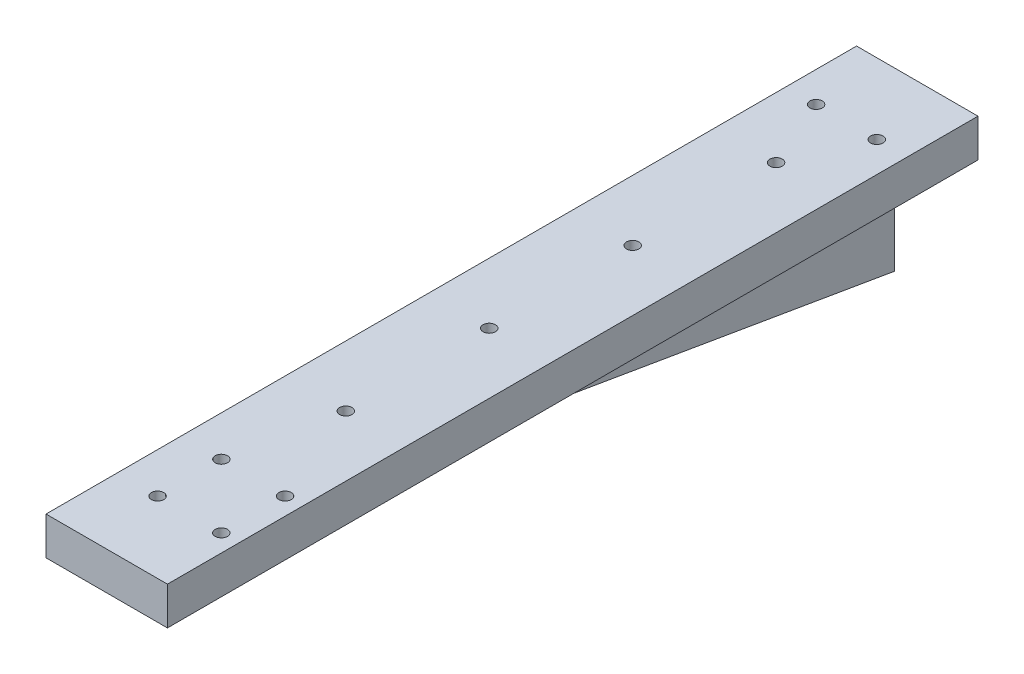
ISO-10303-21;
HEADER;
FILE_DESCRIPTION(('STEP AP214'),'2;1');
FILE_NAME('part.step','',(''),(''),'','','');
FILE_SCHEMA(('AUTOMOTIVE_DESIGN { 1 0 10303 214 1 1 1 1 }'));
ENDSEC;
DATA;
#1=APPLICATION_CONTEXT('core data for automotive mechanical design processes');
#2=APPLICATION_PROTOCOL_DEFINITION('international standard','automotive_design',2000,#1);
#3=PRODUCT_CONTEXT('',#1,'mechanical');
#4=PRODUCT('Part','Part','',(#3));
#5=PRODUCT_RELATED_PRODUCT_CATEGORY('part','',(#4));
#6=PRODUCT_DEFINITION_FORMATION('','',#4);
#7=PRODUCT_DEFINITION_CONTEXT('part definition',#1,'design');
#8=PRODUCT_DEFINITION('design','',#6,#7);
#9=PRODUCT_DEFINITION_SHAPE('','',#8);
#10=(LENGTH_UNIT() NAMED_UNIT(*) SI_UNIT(.MILLI.,.METRE.));
#11=(NAMED_UNIT(*) PLANE_ANGLE_UNIT() SI_UNIT($,.RADIAN.));
#12=(NAMED_UNIT(*) SI_UNIT($,.STERADIAN.) SOLID_ANGLE_UNIT());
#13=UNCERTAINTY_MEASURE_WITH_UNIT(LENGTH_MEASURE(1.E-05),#10,'distance_accuracy_value','');
#14=(GEOMETRIC_REPRESENTATION_CONTEXT(3) GLOBAL_UNCERTAINTY_ASSIGNED_CONTEXT((#13)) GLOBAL_UNIT_ASSIGNED_CONTEXT((#10,
#11,#12)) REPRESENTATION_CONTEXT('',''));
#15=CARTESIAN_POINT('',(0.,0.,0.));
#16=DIRECTION('',(0.,0.,1.));
#17=DIRECTION('',(1.,0.,0.));
#18=AXIS2_PLACEMENT_3D('',#15,#16,#17);
#19=CARTESIAN_POINT('',(-12.7,3.9624,169.545));
#20=DIRECTION('',(1.,0.,0.));
#21=DIRECTION('',(0.,1.,0.));
#22=AXIS2_PLACEMENT_3D('',#19,#20,#21);
#23=PLANE('',#22);
#24=CARTESIAN_POINT('',(-12.7,-16.4338,5.3975));
#25=DIRECTION('',(-1.,0.,0.));
#26=DIRECTION('',(0.,0.,1.));
#27=AXIS2_PLACEMENT_3D('',#24,#25,#26);
#28=CIRCLE('',#27,1.19062499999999);
#29=CARTESIAN_POINT('',(-12.7,-16.4338,6.58812499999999));
#30=VERTEX_POINT('',#29);
#31=EDGE_CURVE('E322',#30,#30,#28,.T.);
#32=ORIENTED_EDGE('',*,*,#31,.F.);
#33=EDGE_LOOP('',(#32));
#34=FACE_BOUND('',#33,.T.);
#35=CARTESIAN_POINT('',(-12.7,-4.49579999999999,5.3975));
#36=DIRECTION('',(-1.,0.,0.));
#37=DIRECTION('',(0.,0.,1.));
#38=AXIS2_PLACEMENT_3D('',#35,#36,#37);
#39=CIRCLE('',#38,1.28904999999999);
#40=CARTESIAN_POINT('',(-12.7,-4.49579999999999,6.68654999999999));
#41=VERTEX_POINT('',#40);
#42=EDGE_CURVE('E180',#41,#41,#39,.T.);
#43=ORIENTED_EDGE('',*,*,#42,.F.);
#44=EDGE_LOOP('',(#43));
#45=FACE_BOUND('',#44,.T.);
#46=DIRECTION('',(0.,-1.,0.));
#47=VECTOR('',#46,1.);
#48=CARTESIAN_POINT('',(-12.7,3.9624,0.));
#49=LINE('',#48,#47);
#50=CARTESIAN_POINT('',(-12.7,3.9624,0.));
#51=VERTEX_POINT('',#50);
#52=CARTESIAN_POINT('',(-12.7,-32.8676,0.));
#53=VERTEX_POINT('',#52);
#54=EDGE_CURVE('E208',#51,#53,#49,.T.);
#55=ORIENTED_EDGE('',*,*,#54,.T.);
#56=DIRECTION('',(0.,0.167990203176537,0.985788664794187));
#57=VECTOR('',#56,1.);
#58=CARTESIAN_POINT('',(-12.7,-32.8676,0.));
#59=LINE('',#58,#57);
#60=CARTESIAN_POINT('',(-12.7,-3.9751,169.545));
#61=VERTEX_POINT('',#60);
#62=EDGE_CURVE('E201',#53,#61,#59,.T.);
#63=ORIENTED_EDGE('',*,*,#62,.T.);
#64=DIRECTION('',(0.,-1.,0.));
#65=VECTOR('',#64,1.);
#66=CARTESIAN_POINT('',(-12.7,3.9624,169.545));
#67=LINE('',#66,#65);
#68=CARTESIAN_POINT('',(-12.7,3.9624,169.545));
#69=VERTEX_POINT('',#68);
#70=EDGE_CURVE('E272',#69,#61,#67,.T.);
#71=ORIENTED_EDGE('',*,*,#70,.F.);
#72=DIRECTION('',(0.,0.,-1.));
#73=VECTOR('',#72,1.);
#74=CARTESIAN_POINT('',(-12.7,3.9624,169.545));
#75=LINE('',#74,#73);
#76=EDGE_CURVE('E287',#69,#51,#75,.T.);
#77=ORIENTED_EDGE('',*,*,#76,.T.);
#78=EDGE_LOOP('',(#55,#63,#71,#77));
#79=FACE_BOUND('',#78,.T.);
#80=ADVANCED_FACE('F32',(#34,#45,#79),#23,.F.);
#81=CARTESIAN_POINT('',(-12.7,-3.9751,169.545));
#82=DIRECTION('',(0.,1.,0.));
#83=DIRECTION('',(0.,0.,1.));
#84=AXIS2_PLACEMENT_3D('',#81,#82,#83);
#85=PLANE('',#84);
#86=CARTESIAN_POINT('',(6.35,-3.9751,14.8082));
#87=DIRECTION('',(0.,1.,0.));
#88=DIRECTION('',(0.,0.,1.));
#89=AXIS2_PLACEMENT_3D('',#86,#87,#88);
#90=CIRCLE('',#89,1.28904999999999);
#91=CARTESIAN_POINT('',(6.35,-3.9751,16.09725));
#92=VERTEX_POINT('',#91);
#93=EDGE_CURVE('E128',#92,#92,#90,.T.);
#94=ORIENTED_EDGE('',*,*,#93,.T.);
#95=EDGE_LOOP('',(#94));
#96=FACE_BOUND('',#95,.T.);
#97=CARTESIAN_POINT('',(9.04875,-3.9751,154.6225));
#98=DIRECTION('',(0.,1.,0.));
#99=DIRECTION('',(0.,0.,1.));
#100=AXIS2_PLACEMENT_3D('',#97,#98,#99);
#101=CIRCLE('',#100,1.28904999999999);
#102=CARTESIAN_POINT('',(9.04875,-3.9751,155.91155));
#103=VERTEX_POINT('',#102);
#104=EDGE_CURVE('E161',#103,#103,#101,.T.);
#105=ORIENTED_EDGE('',*,*,#104,.T.);
#106=EDGE_LOOP('',(#105));
#107=FACE_BOUND('',#106,.T.);
#108=CARTESIAN_POINT('',(9.04875,-3.9751,141.2875));
#109=DIRECTION('',(0.,1.,0.));
#110=DIRECTION('',(0.,0.,1.));
#111=AXIS2_PLACEMENT_3D('',#108,#109,#110);
#112=CIRCLE('',#111,1.28904999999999);
#113=CARTESIAN_POINT('',(9.04875,-3.9751,142.57655));
#114=VERTEX_POINT('',#113);
#115=EDGE_CURVE('E175',#114,#114,#112,.T.);
#116=ORIENTED_EDGE('',*,*,#115,.T.);
#117=EDGE_LOOP('',(#116));
#118=FACE_BOUND('',#117,.T.);
#119=DIRECTION('',(1.,0.,0.));
#120=VECTOR('',#119,1.);
#121=CARTESIAN_POINT('',(-12.7,-3.9751,169.545));
#122=LINE('',#121,#120);
#123=CARTESIAN_POINT('',(1.5875,-3.9751,169.545));
#124=VERTEX_POINT('',#123);
#125=CARTESIAN_POINT('',(12.7,-3.9751,169.545));
#126=VERTEX_POINT('',#125);
#127=EDGE_CURVE('E219',#124,#126,#122,.T.);
#128=ORIENTED_EDGE('',*,*,#127,.F.);
#129=DIRECTION('',(0.,0.,-1.));
#130=VECTOR('',#129,1.);
#131=CARTESIAN_POINT('',(1.5875,-3.9751,0.));
#132=LINE('',#131,#130);
#133=CARTESIAN_POINT('',(1.5875,-3.9751,0.));
#134=VERTEX_POINT('',#133);
#135=EDGE_CURVE('E222',#124,#134,#132,.T.);
#136=ORIENTED_EDGE('',*,*,#135,.T.);
#137=DIRECTION('',(1.,0.,0.));
#138=VECTOR('',#137,1.);
#139=CARTESIAN_POINT('',(-12.7,-3.9751,0.));
#140=LINE('',#139,#138);
#141=CARTESIAN_POINT('',(12.7,-3.9751,0.));
#142=VERTEX_POINT('',#141);
#143=EDGE_CURVE('E211',#134,#142,#140,.T.);
#144=ORIENTED_EDGE('',*,*,#143,.T.);
#145=DIRECTION('',(0.,0.,-1.));
#146=VECTOR('',#145,1.);
#147=CARTESIAN_POINT('',(12.7,-3.9751,169.545));
#148=LINE('',#147,#146);
#149=EDGE_CURVE('E226',#126,#142,#148,.T.);
#150=ORIENTED_EDGE('',*,*,#149,.F.);
#151=EDGE_LOOP('',(#128,#136,#144,#150));
#152=FACE_BOUND('',#151,.T.);
#153=ADVANCED_FACE('F309',(#96,#107,#118,#152),#85,.F.);
#154=CARTESIAN_POINT('',(12.7,3.9624,169.545));
#155=DIRECTION('',(-1.,0.,0.));
#156=DIRECTION('',(0.,0.,1.));
#157=AXIS2_PLACEMENT_3D('',#154,#155,#156);
#158=PLANE('',#157);
#159=DIRECTION('',(0.,1.,0.));
#160=VECTOR('',#159,1.);
#161=CARTESIAN_POINT('',(12.7,3.9624,0.));
#162=LINE('',#161,#160);
#163=CARTESIAN_POINT('',(12.7,3.9624,0.));
#164=VERTEX_POINT('',#163);
#165=EDGE_CURVE('E214',#142,#164,#162,.T.);
#166=ORIENTED_EDGE('',*,*,#165,.T.);
#167=DIRECTION('',(0.,0.,-1.));
#168=VECTOR('',#167,1.);
#169=CARTESIAN_POINT('',(12.7,3.9624,169.545));
#170=LINE('',#169,#168);
#171=CARTESIAN_POINT('',(12.7,3.9624,169.545));
#172=VERTEX_POINT('',#171);
#173=EDGE_CURVE('E289',#172,#164,#170,.T.);
#174=ORIENTED_EDGE('',*,*,#173,.F.);
#175=DIRECTION('',(0.,1.,0.));
#176=VECTOR('',#175,1.);
#177=CARTESIAN_POINT('',(12.7,3.9624,169.545));
#178=LINE('',#177,#176);
#179=EDGE_CURVE('E283',#126,#172,#178,.T.);
#180=ORIENTED_EDGE('',*,*,#179,.F.);
#181=ORIENTED_EDGE('',*,*,#149,.T.);
#182=EDGE_LOOP('',(#166,#174,#180,#181));
#183=FACE_BOUND('',#182,.T.);
#184=ADVANCED_FACE('F296',(#183),#158,.F.);
#185=CARTESIAN_POINT('',(-12.7,3.9624,169.545));
#186=DIRECTION('',(0.,-1.,0.));
#187=DIRECTION('',(0.,0.,-1.));
#188=AXIS2_PLACEMENT_3D('',#185,#186,#187);
#189=PLANE('',#188);
#190=CARTESIAN_POINT('',(-6.35,3.9624,14.8082));
#191=DIRECTION('',(0.,1.,0.));
#192=DIRECTION('',(0.,0.,1.));
#193=AXIS2_PLACEMENT_3D('',#190,#191,#192);
#194=CIRCLE('',#193,1.28904999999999);
#195=CARTESIAN_POINT('',(-6.35,3.9624,16.09725));
#196=VERTEX_POINT('',#195);
#197=EDGE_CURVE('E719',#196,#196,#194,.T.);
#198=ORIENTED_EDGE('',*,*,#197,.F.);
#199=EDGE_LOOP('',(#198));
#200=FACE_BOUND('',#199,.T.);
#201=CARTESIAN_POINT('',(6.35,3.9624,14.8082));
#202=DIRECTION('',(0.,1.,0.));
#203=DIRECTION('',(0.,0.,1.));
#204=AXIS2_PLACEMENT_3D('',#201,#202,#203);
#205=CIRCLE('',#204,1.28904999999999);
#206=CARTESIAN_POINT('',(6.35,3.9624,16.09725));
#207=VERTEX_POINT('',#206);
#208=EDGE_CURVE('E134',#207,#207,#205,.T.);
#209=ORIENTED_EDGE('',*,*,#208,.F.);
#210=EDGE_LOOP('',(#209));
#211=FACE_BOUND('',#210,.T.);
#212=CARTESIAN_POINT('',(0.,3.9624,29.5326));
#213=DIRECTION('',(0.,1.,0.));
#214=DIRECTION('',(0.,0.,1.));
#215=AXIS2_PLACEMENT_3D('',#212,#213,#214);
#216=CIRCLE('',#215,1.28904999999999);
#217=CARTESIAN_POINT('',(0.,3.9624,30.82165));
#218=VERTEX_POINT('',#217);
#219=EDGE_CURVE('E143',#218,#218,#216,.T.);
#220=ORIENTED_EDGE('',*,*,#219,.F.);
#221=EDGE_LOOP('',(#220));
#222=FACE_BOUND('',#221,.T.);
#223=CARTESIAN_POINT('',(0.,3.9624,59.5326));
#224=DIRECTION('',(0.,1.,0.));
#225=DIRECTION('',(0.,0.,1.));
#226=AXIS2_PLACEMENT_3D('',#223,#224,#225);
#227=CIRCLE('',#226,1.28904999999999);
#228=CARTESIAN_POINT('',(0.,3.9624,60.82165));
#229=VERTEX_POINT('',#228);
#230=EDGE_CURVE('E146',#229,#229,#227,.T.);
#231=ORIENTED_EDGE('',*,*,#230,.F.);
#232=EDGE_LOOP('',(#231));
#233=FACE_BOUND('',#232,.T.);
#234=CARTESIAN_POINT('',(0.,3.9624,89.5326));
#235=DIRECTION('',(0.,1.,0.));
#236=DIRECTION('',(0.,0.,1.));
#237=AXIS2_PLACEMENT_3D('',#234,#235,#236);
#238=CIRCLE('',#237,1.28904999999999);
#239=CARTESIAN_POINT('',(0.,3.9624,90.82165));
#240=VERTEX_POINT('',#239);
#241=EDGE_CURVE('E150',#240,#240,#238,.T.);
#242=ORIENTED_EDGE('',*,*,#241,.F.);
#243=EDGE_LOOP('',(#242));
#244=FACE_BOUND('',#243,.T.);
#245=CARTESIAN_POINT('',(0.,3.9624,119.5326));
#246=DIRECTION('',(0.,1.,0.));
#247=DIRECTION('',(0.,0.,1.));
#248=AXIS2_PLACEMENT_3D('',#245,#246,#247);
#249=CIRCLE('',#248,1.28904999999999);
#250=CARTESIAN_POINT('',(0.,3.9624,120.82165));
#251=VERTEX_POINT('',#250);
#252=EDGE_CURVE('E154',#251,#251,#249,.T.);
#253=ORIENTED_EDGE('',*,*,#252,.F.);
#254=EDGE_LOOP('',(#253));
#255=FACE_BOUND('',#254,.T.);
#256=CARTESIAN_POINT('',(9.04875,3.9624,154.6225));
#257=DIRECTION('',(0.,1.,0.));
#258=DIRECTION('',(0.,0.,1.));
#259=AXIS2_PLACEMENT_3D('',#256,#257,#258);
#260=CIRCLE('',#259,1.28904999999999);
#261=CARTESIAN_POINT('',(9.04875,3.9624,155.91155));
#262=VERTEX_POINT('',#261);
#263=EDGE_CURVE('E158',#262,#262,#260,.T.);
#264=ORIENTED_EDGE('',*,*,#263,.F.);
#265=EDGE_LOOP('',(#264));
#266=FACE_BOUND('',#265,.T.);
#267=CARTESIAN_POINT('',(-4.28625,3.9624,154.6225));
#268=DIRECTION('',(0.,1.,0.));
#269=DIRECTION('',(0.,0.,1.));
#270=AXIS2_PLACEMENT_3D('',#267,#268,#269);
#271=CIRCLE('',#270,1.28904999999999);
#272=CARTESIAN_POINT('',(-4.28625,3.9624,155.91155));
#273=VERTEX_POINT('',#272);
#274=EDGE_CURVE('E164',#273,#273,#271,.T.);
#275=ORIENTED_EDGE('',*,*,#274,.F.);
#276=EDGE_LOOP('',(#275));
#277=FACE_BOUND('',#276,.T.);
#278=CARTESIAN_POINT('',(-4.28625,3.9624,141.2875));
#279=DIRECTION('',(0.,1.,0.));
#280=DIRECTION('',(0.,0.,1.));
#281=AXIS2_PLACEMENT_3D('',#278,#279,#280);
#282=CIRCLE('',#281,1.28904999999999);
#283=CARTESIAN_POINT('',(-4.28625,3.9624,142.57655));
#284=VERTEX_POINT('',#283);
#285=EDGE_CURVE('E168',#284,#284,#282,.T.);
#286=ORIENTED_EDGE('',*,*,#285,.F.);
#287=EDGE_LOOP('',(#286));
#288=FACE_BOUND('',#287,.T.);
#289=CARTESIAN_POINT('',(9.04875,3.9624,141.2875));
#290=DIRECTION('',(0.,1.,0.));
#291=DIRECTION('',(0.,0.,1.));
#292=AXIS2_PLACEMENT_3D('',#289,#290,#291);
#293=CIRCLE('',#292,1.28904999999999);
#294=CARTESIAN_POINT('',(9.04875,3.9624,142.57655));
#295=VERTEX_POINT('',#294);
#296=EDGE_CURVE('E172',#295,#295,#293,.T.);
#297=ORIENTED_EDGE('',*,*,#296,.F.);
#298=EDGE_LOOP('',(#297));
#299=FACE_BOUND('',#298,.T.);
#300=DIRECTION('',(-1.,0.,0.));
#301=VECTOR('',#300,1.);
#302=CARTESIAN_POINT('',(-12.7,3.9624,0.));
#303=LINE('',#302,#301);
#304=EDGE_CURVE('E279',#164,#51,#303,.T.);
#305=ORIENTED_EDGE('',*,*,#304,.T.);
#306=ORIENTED_EDGE('',*,*,#76,.F.);
#307=DIRECTION('',(-1.,0.,0.));
#308=VECTOR('',#307,1.);
#309=CARTESIAN_POINT('',(-12.7,3.9624,169.545));
#310=LINE('',#309,#308);
#311=EDGE_CURVE('E277',#172,#69,#310,.T.);
#312=ORIENTED_EDGE('',*,*,#311,.F.);
#313=ORIENTED_EDGE('',*,*,#173,.T.);
#314=EDGE_LOOP('',(#305,#306,#312,#313));
#315=FACE_BOUND('',#314,.T.);
#316=ADVANCED_FACE('F300',(#200,#211,#222,#233,#244,#255,#266,#277,#288,#299,#315),#189,.F.);
#317=CARTESIAN_POINT('',(-12.7,-3.9751,169.545));
#318=DIRECTION('',(0.,0.,1.));
#319=DIRECTION('',(1.,0.,0.));
#320=AXIS2_PLACEMENT_3D('',#317,#318,#319);
#321=PLANE('',#320);
#322=ORIENTED_EDGE('',*,*,#70,.T.);
#323=EDGE_CURVE('E233',#61,#124,#122,.T.);
#324=ORIENTED_EDGE('',*,*,#323,.T.);
#325=ORIENTED_EDGE('',*,*,#127,.T.);
#326=ORIENTED_EDGE('',*,*,#179,.T.);
#327=ORIENTED_EDGE('',*,*,#311,.T.);
#328=EDGE_LOOP('',(#322,#324,#325,#326,#327));
#329=FACE_BOUND('',#328,.T.);
#330=ADVANCED_FACE('F274',(#329),#321,.T.);
#331=CARTESIAN_POINT('',(-12.7,-3.9751,0.));
#332=DIRECTION('',(0.,0.,1.));
#333=DIRECTION('',(1.,0.,0.));
#334=AXIS2_PLACEMENT_3D('',#331,#332,#333);
#335=PLANE('',#334);
#336=CARTESIAN_POINT('',(-8.7376,-12.6238,0.));
#337=DIRECTION('',(0.,0.,-1.));
#338=DIRECTION('',(-1.,0.,0.));
#339=AXIS2_PLACEMENT_3D('',#336,#337,#338);
#340=CIRCLE('',#339,2.39395);
#341=CARTESIAN_POINT('',(-11.13155,-12.6238,0.));
#342=VERTEX_POINT('',#341);
#343=EDGE_CURVE('E127',#342,#342,#340,.T.);
#344=ORIENTED_EDGE('',*,*,#343,.F.);
#345=EDGE_LOOP('',(#344));
#346=FACE_BOUND('',#345,.T.);
#347=CARTESIAN_POINT('',(0.,0.,0.));
#348=DIRECTION('',(0.,0.,-1.));
#349=DIRECTION('',(-1.,0.,0.));
#350=AXIS2_PLACEMENT_3D('',#347,#348,#349);
#351=CIRCLE('',#350,2.39395);
#352=CARTESIAN_POINT('',(-2.39395,0.,0.));
#353=VERTEX_POINT('',#352);
#354=EDGE_CURVE('E140',#353,#353,#351,.T.);
#355=ORIENTED_EDGE('',*,*,#354,.F.);
#356=EDGE_LOOP('',(#355));
#357=FACE_BOUND('',#356,.T.);
#358=CARTESIAN_POINT('',(-8.7376,0.,0.));
#359=DIRECTION('',(0.,0.,-1.));
#360=DIRECTION('',(-1.,0.,0.));
#361=AXIS2_PLACEMENT_3D('',#358,#359,#360);
#362=CIRCLE('',#361,1.7272);
#363=CARTESIAN_POINT('',(-10.4648,0.,0.));
#364=VERTEX_POINT('',#363);
#365=EDGE_CURVE('E186',#364,#364,#362,.T.);
#366=ORIENTED_EDGE('',*,*,#365,.F.);
#367=EDGE_LOOP('',(#366));
#368=FACE_BOUND('',#367,.T.);
#369=CARTESIAN_POINT('',(-8.7376,-25.2476,0.));
#370=DIRECTION('',(0.,0.,-1.));
#371=DIRECTION('',(-1.,0.,0.));
#372=AXIS2_PLACEMENT_3D('',#369,#370,#371);
#373=CIRCLE('',#372,1.7272);
#374=CARTESIAN_POINT('',(-10.4648,-25.2476,0.));
#375=VERTEX_POINT('',#374);
#376=EDGE_CURVE('E192',#375,#375,#373,.T.);
#377=ORIENTED_EDGE('',*,*,#376,.F.);
#378=EDGE_LOOP('',(#377));
#379=FACE_BOUND('',#378,.T.);
#380=CARTESIAN_POINT('',(8.7376,0.,0.));
#381=DIRECTION('',(0.,0.,-1.));
#382=DIRECTION('',(-1.,0.,0.));
#383=AXIS2_PLACEMENT_3D('',#380,#381,#382);
#384=CIRCLE('',#383,1.7272);
#385=CARTESIAN_POINT('',(7.0104,0.,0.));
#386=VERTEX_POINT('',#385);
#387=EDGE_CURVE('E198',#386,#386,#384,.T.);
#388=ORIENTED_EDGE('',*,*,#387,.F.);
#389=EDGE_LOOP('',(#388));
#390=FACE_BOUND('',#389,.T.);
#391=ORIENTED_EDGE('',*,*,#54,.F.);
#392=ORIENTED_EDGE('',*,*,#304,.F.);
#393=ORIENTED_EDGE('',*,*,#165,.F.);
#394=ORIENTED_EDGE('',*,*,#143,.F.);
#395=CARTESIAN_POINT('',(1.5875,-10.3251,0.));
#396=DIRECTION('',(0.,0.,1.));
#397=DIRECTION('',(1.,0.,0.));
#398=AXIS2_PLACEMENT_3D('',#395,#396,#397);
#399=CIRCLE('',#398,6.35);
#400=CARTESIAN_POINT('',(-4.7625,-10.3251,0.));
#401=VERTEX_POINT('',#400);
#402=EDGE_CURVE('E260',#134,#401,#399,.T.);
#403=ORIENTED_EDGE('',*,*,#402,.T.);
#404=DIRECTION('',(0.,-1.,0.));
#405=VECTOR('',#404,1.);
#406=CARTESIAN_POINT('',(-4.7625,-3.9751,0.));
#407=LINE('',#406,#405);
#408=CARTESIAN_POINT('',(-4.7625,-32.8676,0.));
#409=VERTEX_POINT('',#408);
#410=EDGE_CURVE('E204',#401,#409,#407,.T.);
#411=ORIENTED_EDGE('',*,*,#410,.T.);
#412=DIRECTION('',(-1.,0.,0.));
#413=VECTOR('',#412,1.);
#414=CARTESIAN_POINT('',(-4.7625,-32.8676,0.));
#415=LINE('',#414,#413);
#416=EDGE_CURVE('E205',#409,#53,#415,.T.);
#417=ORIENTED_EDGE('',*,*,#416,.T.);
#418=EDGE_LOOP('',(#391,#392,#393,#394,#403,#411,#417));
#419=FACE_BOUND('',#418,.T.);
#420=ADVANCED_FACE('F266',(#346,#357,#368,#379,#390,#419),#335,.F.);
#421=CARTESIAN_POINT('',(-4.7625,-32.8676,0.));
#422=DIRECTION('',(0.,-0.985788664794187,0.167990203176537));
#423=DIRECTION('',(0.,-0.167990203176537,-0.985788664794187));
#424=AXIS2_PLACEMENT_3D('',#421,#422,#423);
#425=PLANE('',#424);
#426=CARTESIAN_POINT('',(-4.28625,-6.51807284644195,154.6225));
#427=DIRECTION('',(0.,-0.985788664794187,0.167990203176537));
#428=DIRECTION('',(0.,0.167990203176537,0.985788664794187));
#429=AXIS2_PLACEMENT_3D('',#426,#427,#428);
#430=ELLIPSE('',#429,1.30763321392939,1.28904999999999);
#431=CARTESIAN_POINT('',(-3.37459987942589,-6.36276927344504,155.533841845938));
#432=VERTEX_POINT('',#431);
#433=CARTESIAN_POINT('',(-3.63109115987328,-6.70725446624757,153.512357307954));
#434=VERTEX_POINT('',#433);
#435=EDGE_CURVE('E51',#432,#434,#430,.T.);
#436=ORIENTED_EDGE('',*,*,#435,.F.);
#437=CARTESIAN_POINT('',(1.5875,-10.3251,132.282362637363));
#438=DIRECTION('',(0.,-0.985788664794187,0.167990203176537));
#439=DIRECTION('',(0.,0.167990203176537,0.985788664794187));
#440=AXIS2_PLACEMENT_3D('',#437,#438,#439);
#441=ELLIPSE('',#440,37.7998233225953,6.35);
#442=EDGE_CURVE('E255',#432,#124,#441,.F.);
#443=ORIENTED_EDGE('',*,*,#442,.T.);
#444=ORIENTED_EDGE('',*,*,#323,.F.);
#445=ORIENTED_EDGE('',*,*,#62,.F.);
#446=ORIENTED_EDGE('',*,*,#416,.F.);
#447=DIRECTION('',(0.,0.167990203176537,0.985788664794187));
#448=VECTOR('',#447,1.);
#449=CARTESIAN_POINT('',(-4.7625,-32.8676,0.));
#450=LINE('',#449,#448);
#451=CARTESIAN_POINT('',(-4.7625,-10.3251,132.282362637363));
#452=VERTEX_POINT('',#451);
#453=EDGE_CURVE('E209',#409,#452,#450,.T.);
#454=ORIENTED_EDGE('',*,*,#453,.T.);
#455=CARTESIAN_POINT('',(-4.62324495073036,-9.00254672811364,140.043279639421));
#456=VERTEX_POINT('',#455);
#457=EDGE_CURVE('E243',#452,#456,#441,.F.);
#458=ORIENTED_EDGE('',*,*,#457,.T.);
#459=CARTESIAN_POINT('',(-4.28625,-8.79051666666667,141.2875));
#460=DIRECTION('',(0.,-0.985788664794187,0.167990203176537));
#461=DIRECTION('',(0.,0.167990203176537,0.985788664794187));
#462=AXIS2_PLACEMENT_3D('',#459,#460,#461);
#463=ELLIPSE('',#462,1.30763321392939,1.28904999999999);
#464=CARTESIAN_POINT('',(-4.51638947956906,-8.57437637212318,142.5558397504));
#465=VERTEX_POINT('',#464);
#466=EDGE_CURVE('E57',#465,#456,#463,.T.);
#467=ORIENTED_EDGE('',*,*,#466,.F.);
#468=EDGE_CURVE('E253',#465,#434,#441,.F.);
#469=ORIENTED_EDGE('',*,*,#468,.T.);
#470=EDGE_LOOP('',(#436,#443,#444,#445,#446,#454,#458,#467,#469));
#471=FACE_BOUND('',#470,.T.);
#472=ADVANCED_FACE('F242',(#471),#425,.T.);
#473=CARTESIAN_POINT('',(-4.7625,-3.9751,0.));
#474=DIRECTION('',(-1.,0.,0.));
#475=DIRECTION('',(0.,0.,1.));
#476=AXIS2_PLACEMENT_3D('',#473,#474,#475);
#477=PLANE('',#476);
#478=ORIENTED_EDGE('',*,*,#410,.F.);
#479=DIRECTION('',(0.,0.,-1.));
#480=VECTOR('',#479,1.);
#481=CARTESIAN_POINT('',(-4.7625,-10.3251,169.545));
#482=LINE('',#481,#480);
#483=EDGE_CURVE('E225',#401,#452,#482,.F.);
#484=ORIENTED_EDGE('',*,*,#483,.T.);
#485=ORIENTED_EDGE('',*,*,#453,.F.);
#486=EDGE_LOOP('',(#478,#484,#485));
#487=FACE_BOUND('',#486,.T.);
#488=ADVANCED_FACE('F264',(#487),#477,.F.);
#489=CARTESIAN_POINT('',(1.5875,-10.3251,169.545));
#490=DIRECTION('',(0.,0.,1.));
#491=DIRECTION('',(1.,0.,0.));
#492=AXIS2_PLACEMENT_3D('',#489,#490,#491);
#493=CYLINDRICAL_SURFACE('',#492,6.35);
#494=CARTESIAN_POINT('',(0.,-4.17673893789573,30.82165));
#495=CARTESIAN_POINT('',(0.0709354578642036,-4.15842422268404,30.821648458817));
#496=CARTESIAN_POINT('',(0.142209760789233,-4.14134203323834,30.8157798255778));
#497=CARTESIAN_POINT('',(0.283424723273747,-4.11002780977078,30.7921421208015));
#498=CARTESIAN_POINT('',(0.353365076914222,-4.09579642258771,30.7743703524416));
#499=CARTESIAN_POINT('',(0.489849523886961,-4.07030261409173,30.7271360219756));
#500=CARTESIAN_POINT('',(0.556389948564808,-4.05904334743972,30.6976611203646));
#501=CARTESIAN_POINT('',(0.683872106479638,-4.03939227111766,30.6277047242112));
#502=CARTESIAN_POINT('',(0.744814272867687,-4.03100023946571,30.5872240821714));
#503=CARTESIAN_POINT('',(0.858065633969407,-4.01688095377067,30.4972276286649));
#504=CARTESIAN_POINT('',(0.910516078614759,-4.01110638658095,30.4478968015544));
#505=CARTESIAN_POINT('',(1.00655461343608,-4.0015458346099,30.3410896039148));
#506=CARTESIAN_POINT('',(1.05014275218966,-3.99775983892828,30.283613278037));
#507=CARTESIAN_POINT('',(1.12708882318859,-3.9916953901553,30.1622613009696));
#508=CARTESIAN_POINT('',(1.16046568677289,-3.98941413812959,30.0983977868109));
#509=CARTESIAN_POINT('',(1.21613627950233,-3.98590674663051,29.9659832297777));
#510=CARTESIAN_POINT('',(1.2384297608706,-3.98468063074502,29.8974320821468));
#511=CARTESIAN_POINT('',(1.27138697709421,-3.98295136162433,29.7571911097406));
#512=CARTESIAN_POINT('',(1.28198769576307,-3.98245212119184,29.6854864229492));
#513=CARTESIAN_POINT('',(1.2910427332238,-3.98202233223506,29.5413119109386));
#514=CARTESIAN_POINT('',(1.28949683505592,-3.98209179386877,29.4688420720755));
#515=CARTESIAN_POINT('',(1.27428516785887,-3.98282490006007,29.3250251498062));
#516=CARTESIAN_POINT('',(1.26059251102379,-3.98348986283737,29.2536809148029));
#517=CARTESIAN_POINT('',(1.2214423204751,-3.98562976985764,29.1143084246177));
#518=CARTESIAN_POINT('',(1.19598472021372,-3.98710471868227,29.046280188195));
#519=CARTESIAN_POINT('',(1.13406501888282,-3.99123436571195,28.9155305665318));
#520=CARTESIAN_POINT('',(1.09761114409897,-3.99388818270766,28.8528052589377));
#521=CARTESIAN_POINT('',(1.01476743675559,-4.00084518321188,28.7344040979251));
#522=CARTESIAN_POINT('',(0.968378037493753,-4.00514829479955,28.678727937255));
#523=CARTESIAN_POINT('',(0.86728796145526,-4.01587182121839,28.5762427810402));
#524=CARTESIAN_POINT('',(0.812624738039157,-4.02228284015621,28.5293958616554));
#525=CARTESIAN_POINT('',(0.696517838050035,-4.03764635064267,28.4455677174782));
#526=CARTESIAN_POINT('',(0.635074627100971,-4.04659866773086,28.4085858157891));
#527=CARTESIAN_POINT('',(0.507540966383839,-4.06727756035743,28.3455474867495));
#528=CARTESIAN_POINT('',(0.441468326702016,-4.07899387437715,28.3194516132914));
#529=CARTESIAN_POINT('',(0.306470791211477,-4.10527754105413,28.2785259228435));
#530=CARTESIAN_POINT('',(0.237545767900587,-4.11984502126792,28.2636966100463));
#531=CARTESIAN_POINT('',(0.0978378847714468,-4.15188253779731,28.2453112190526));
#532=CARTESIAN_POINT('',(0.0270425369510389,-4.16939072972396,28.241917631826));
#533=CARTESIAN_POINT('',(-0.113535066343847,-4.20674447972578,28.2466336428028));
#534=CARTESIAN_POINT('',(-0.183317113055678,-4.22659051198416,28.2547455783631));
#535=CARTESIAN_POINT('',(-0.323025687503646,-4.26886868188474,28.2825649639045));
#536=CARTESIAN_POINT('',(-0.392836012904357,-4.29137429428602,28.3027435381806));
#537=CARTESIAN_POINT('',(-0.527830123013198,-4.33736494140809,28.3543506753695));
#538=CARTESIAN_POINT('',(-0.593012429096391,-4.36085028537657,28.3857828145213));
#539=CARTESIAN_POINT('',(-0.720124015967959,-4.40883454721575,28.4607952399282));
#540=CARTESIAN_POINT('',(-0.781763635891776,-4.43333013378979,28.5048699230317));
#541=CARTESIAN_POINT('',(-0.896721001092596,-4.48087025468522,28.6034731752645));
#542=CARTESIAN_POINT('',(-0.95003703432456,-4.50391448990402,28.658003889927));
#543=CARTESIAN_POINT('',(-1.04651998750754,-4.54693216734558,28.7761351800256));
#544=CARTESIAN_POINT('',(-1.08972301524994,-4.56691644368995,28.8397021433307));
#545=CARTESIAN_POINT('',(-1.16451600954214,-4.60228344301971,28.9744958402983));
#546=CARTESIAN_POINT('',(-1.19611446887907,-4.61766952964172,29.0457169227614));
#547=CARTESIAN_POINT('',(-1.2440722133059,-4.64131969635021,29.1875396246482));
#548=CARTESIAN_POINT('',(-1.26147431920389,-4.65006692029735,29.2577068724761));
#549=CARTESIAN_POINT('',(-1.28428647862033,-4.66157515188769,29.4004285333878));
#550=CARTESIAN_POINT('',(-1.28970511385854,-4.66434044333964,29.4729812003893));
#551=CARTESIAN_POINT('',(-1.28833269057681,-4.66364434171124,29.6112778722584));
#552=CARTESIAN_POINT('',(-1.28261174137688,-4.66072866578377,29.6770384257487));
#553=CARTESIAN_POINT('',(-1.26131711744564,-4.64998930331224,29.8065221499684));
#554=CARTESIAN_POINT('',(-1.24574338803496,-4.64216558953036,29.870245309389));
#555=CARTESIAN_POINT('',(-1.20547870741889,-4.62227027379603,29.9937724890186));
#556=CARTESIAN_POINT('',(-1.18081831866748,-4.61021291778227,30.053588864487));
#557=CARTESIAN_POINT('',(-1.12326012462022,-4.58268812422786,30.168253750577));
#558=CARTESIAN_POINT('',(-1.09036009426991,-4.56721976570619,30.2231009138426));
#559=CARTESIAN_POINT('',(-1.01427954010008,-4.53242113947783,30.331098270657));
#560=CARTESIAN_POINT('',(-0.970477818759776,-4.51287836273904,30.3837417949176));
#561=CARTESIAN_POINT('',(-0.875530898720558,-4.47201103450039,30.4811391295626));
#562=CARTESIAN_POINT('',(-0.824381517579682,-4.45068547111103,30.525888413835));
#563=CARTESIAN_POINT('',(-0.710921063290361,-4.40531776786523,30.6104184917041));
#564=CARTESIAN_POINT('',(-0.648016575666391,-4.38120584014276,30.6493674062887));
#565=CARTESIAN_POINT('',(-0.516391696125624,-4.33335275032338,30.7159962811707));
#566=CARTESIAN_POINT('',(-0.447673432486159,-4.30961145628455,30.7436803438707));
#567=CARTESIAN_POINT('',(-0.316311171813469,-4.26687687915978,30.7838438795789));
#568=CARTESIAN_POINT('',(-0.254219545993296,-4.24769250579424,30.7979398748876));
#569=CARTESIAN_POINT('',(-0.128177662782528,-4.21091510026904,30.8168428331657));
#570=CARTESIAN_POINT('',(-0.064227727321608,-4.1933217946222,30.8216513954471));
#571=CARTESIAN_POINT('',(0.,-4.17673893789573,30.82165));
#572=B_SPLINE_CURVE_WITH_KNOTS('',3,(#494,#495,#496,#497,#498,#499,#500,#501,#502,#503,#504,
#505,#506,#507,#508,#509,#510,#511,#512,#513,#514,#515,#516,#517,#518,#519,#520,#521,#522,#523,
#524,#525,#526,#527,#528,#529,#530,#531,#532,#533,#534,#535,#536,#537,#538,#539,#540,#541,#542,
#543,#544,#545,#546,#547,#548,#549,#550,#551,#552,#553,#554,#555,#556,#557,#558,#559,#560,#561,
#562,#563,#564,#565,#566,#567,#568,#569,#570,#571),.UNSPECIFIED.,.T.,.F.,(4,2,2,2,2,2,2,2,2,2,2,
2,2,2,2,2,2,2,2,2,2,2,2,2,2,2,2,2,2,2,2,2,2,2,2,2,2,2,4),(0.,0.219560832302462,0.43917142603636,
0.659014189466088,0.878839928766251,1.09451596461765,1.31019081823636,1.52546336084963,
1.74074071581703,1.95717268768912,2.1736085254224,2.390524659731,2.6074420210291,
2.82419750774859,3.04094354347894,3.25673625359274,3.47251415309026,3.68750323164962,
3.90250193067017,4.12054296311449,4.33862829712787,4.56584168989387,4.7931273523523,
5.03091957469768,5.2687606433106,5.50573910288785,5.74254378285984,5.95979657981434,
6.17689374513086,6.37415963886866,6.57142662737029,6.76803608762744,6.96469869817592,
7.17746418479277,7.39035126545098,7.62275971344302,7.85508344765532,8.0539166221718,
8.25271555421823),.UNSPECIFIED.);
#573=CARTESIAN_POINT('',(0.,-4.17673893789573,30.82165));
#574=VERTEX_POINT('',#573);
#575=EDGE_CURVE('E35',#574,#574,#572,.T.);
#576=ORIENTED_EDGE('',*,*,#575,.T.);
#577=EDGE_LOOP('',(#576));
#578=FACE_BOUND('',#577,.T.);
#579=CARTESIAN_POINT('',(0.,-4.17673893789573,60.82165));
#580=CARTESIAN_POINT('',(0.0709354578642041,-4.15842422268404,60.821648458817));
#581=CARTESIAN_POINT('',(0.142209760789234,-4.14134203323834,60.8157798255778));
#582=CARTESIAN_POINT('',(0.283424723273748,-4.11002780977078,60.7921421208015));
#583=CARTESIAN_POINT('',(0.353365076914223,-4.09579642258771,60.7743703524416));
#584=CARTESIAN_POINT('',(0.489849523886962,-4.07030261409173,60.7271360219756));
#585=CARTESIAN_POINT('',(0.556389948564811,-4.05904334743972,60.6976611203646));
#586=CARTESIAN_POINT('',(0.683872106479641,-4.03939227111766,60.6277047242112));
#587=CARTESIAN_POINT('',(0.74481427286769,-4.03100023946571,60.5872240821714));
#588=CARTESIAN_POINT('',(0.858065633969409,-4.01688095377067,60.4972276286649));
#589=CARTESIAN_POINT('',(0.910516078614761,-4.01110638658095,60.4478968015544));
#590=CARTESIAN_POINT('',(1.00655461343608,-4.0015458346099,60.3410896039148));
#591=CARTESIAN_POINT('',(1.05014275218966,-3.99775983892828,60.283613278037));
#592=CARTESIAN_POINT('',(1.12708882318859,-3.9916953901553,60.1622613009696));
#593=CARTESIAN_POINT('',(1.16046568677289,-3.98941413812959,60.0983977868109));
#594=CARTESIAN_POINT('',(1.21613627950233,-3.98590674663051,59.9659832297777));
#595=CARTESIAN_POINT('',(1.2384297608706,-3.98468063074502,59.8974320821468));
#596=CARTESIAN_POINT('',(1.27138697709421,-3.98295136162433,59.7571911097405));
#597=CARTESIAN_POINT('',(1.28198769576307,-3.98245212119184,59.6854864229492));
#598=CARTESIAN_POINT('',(1.2910427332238,-3.98202233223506,59.5413119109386));
#599=CARTESIAN_POINT('',(1.28949683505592,-3.98209179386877,59.4688420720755));
#600=CARTESIAN_POINT('',(1.27428516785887,-3.98282490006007,59.3250251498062));
#601=CARTESIAN_POINT('',(1.26059251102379,-3.98348986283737,59.2536809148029));
#602=CARTESIAN_POINT('',(1.2214423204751,-3.98562976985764,59.1143084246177));
#603=CARTESIAN_POINT('',(1.19598472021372,-3.98710471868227,59.046280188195));
#604=CARTESIAN_POINT('',(1.13406501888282,-3.99123436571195,58.9155305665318));
#605=CARTESIAN_POINT('',(1.09761114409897,-3.99388818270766,58.8528052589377));
#606=CARTESIAN_POINT('',(1.01476743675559,-4.00084518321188,58.7344040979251));
#607=CARTESIAN_POINT('',(0.96837803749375,-4.00514829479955,58.678727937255));
#608=CARTESIAN_POINT('',(0.867287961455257,-4.01587182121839,58.5762427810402));
#609=CARTESIAN_POINT('',(0.812624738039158,-4.02228284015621,58.5293958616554));
#610=CARTESIAN_POINT('',(0.696517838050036,-4.03764635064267,58.4455677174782));
#611=CARTESIAN_POINT('',(0.635074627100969,-4.04659866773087,58.4085858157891));
#612=CARTESIAN_POINT('',(0.507540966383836,-4.06727756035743,58.3455474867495));
#613=CARTESIAN_POINT('',(0.441468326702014,-4.07899387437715,58.3194516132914));
#614=CARTESIAN_POINT('',(0.306470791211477,-4.10527754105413,58.2785259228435));
#615=CARTESIAN_POINT('',(0.237545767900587,-4.11984502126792,58.2636966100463));
#616=CARTESIAN_POINT('',(0.0978378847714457,-4.15188253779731,58.2453112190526));
#617=CARTESIAN_POINT('',(0.027042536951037,-4.16939072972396,58.241917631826));
#618=CARTESIAN_POINT('',(-0.11353506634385,-4.20674447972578,58.2466336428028));
#619=CARTESIAN_POINT('',(-0.183317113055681,-4.22659051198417,58.2547455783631));
#620=CARTESIAN_POINT('',(-0.323025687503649,-4.26886868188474,58.2825649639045));
#621=CARTESIAN_POINT('',(-0.392836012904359,-4.29137429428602,58.3027435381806));
#622=CARTESIAN_POINT('',(-0.5278301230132,-4.33736494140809,58.3543506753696));
#623=CARTESIAN_POINT('',(-0.593012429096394,-4.36085028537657,58.3857828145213));
#624=CARTESIAN_POINT('',(-0.720124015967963,-4.40883454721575,58.4607952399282));
#625=CARTESIAN_POINT('',(-0.781763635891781,-4.43333013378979,58.5048699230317));
#626=CARTESIAN_POINT('',(-0.8967210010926,-4.48087025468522,58.6034731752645));
#627=CARTESIAN_POINT('',(-0.950037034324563,-4.50391448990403,58.658003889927));
#628=CARTESIAN_POINT('',(-1.04651998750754,-4.54693216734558,58.7761351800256));
#629=CARTESIAN_POINT('',(-1.08972301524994,-4.56691644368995,58.8397021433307));
#630=CARTESIAN_POINT('',(-1.16451600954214,-4.60228344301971,58.9744958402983));
#631=CARTESIAN_POINT('',(-1.19611446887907,-4.61766952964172,59.0457169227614));
#632=CARTESIAN_POINT('',(-1.2440722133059,-4.64131969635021,59.1875396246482));
#633=CARTESIAN_POINT('',(-1.26147431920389,-4.65006692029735,59.2577068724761));
#634=CARTESIAN_POINT('',(-1.28428647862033,-4.66157515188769,59.4004285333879));
#635=CARTESIAN_POINT('',(-1.28970511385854,-4.66434044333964,59.4729812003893));
#636=CARTESIAN_POINT('',(-1.28833269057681,-4.66364434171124,59.6112778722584));
#637=CARTESIAN_POINT('',(-1.28261174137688,-4.66072866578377,59.6770384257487));
#638=CARTESIAN_POINT('',(-1.26131711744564,-4.64998930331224,59.8065221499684));
#639=CARTESIAN_POINT('',(-1.24574338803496,-4.64216558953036,59.870245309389));
#640=CARTESIAN_POINT('',(-1.20547870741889,-4.62227027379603,59.9937724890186));
#641=CARTESIAN_POINT('',(-1.18081831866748,-4.61021291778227,60.053588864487));
#642=CARTESIAN_POINT('',(-1.12326012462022,-4.58268812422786,60.168253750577));
#643=CARTESIAN_POINT('',(-1.0903600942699,-4.56721976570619,60.2231009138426));
#644=CARTESIAN_POINT('',(-1.01427954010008,-4.53242113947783,60.331098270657));
#645=CARTESIAN_POINT('',(-0.970477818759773,-4.51287836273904,60.3837417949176));
#646=CARTESIAN_POINT('',(-0.875530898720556,-4.47201103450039,60.4811391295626));
#647=CARTESIAN_POINT('',(-0.824381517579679,-4.45068547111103,60.525888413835));
#648=CARTESIAN_POINT('',(-0.710921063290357,-4.40531776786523,60.6104184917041));
#649=CARTESIAN_POINT('',(-0.648016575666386,-4.38120584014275,60.6493674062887));
#650=CARTESIAN_POINT('',(-0.516391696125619,-4.33335275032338,60.7159962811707));
#651=CARTESIAN_POINT('',(-0.447673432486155,-4.30961145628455,60.7436803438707));
#652=CARTESIAN_POINT('',(-0.316311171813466,-4.26687687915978,60.7838438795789));
#653=CARTESIAN_POINT('',(-0.254219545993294,-4.24769250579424,60.7979398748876));
#654=CARTESIAN_POINT('',(-0.128177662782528,-4.21091510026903,60.8168428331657));
#655=CARTESIAN_POINT('',(-0.0642277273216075,-4.1933217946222,60.8216513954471));
#656=CARTESIAN_POINT('',(0.,-4.17673893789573,60.82165));
#657=B_SPLINE_CURVE_WITH_KNOTS('',3,(#579,#580,#581,#582,#583,#584,#585,#586,#587,#588,#589,
#590,#591,#592,#593,#594,#595,#596,#597,#598,#599,#600,#601,#602,#603,#604,#605,#606,#607,#608,
#609,#610,#611,#612,#613,#614,#615,#616,#617,#618,#619,#620,#621,#622,#623,#624,#625,#626,#627,
#628,#629,#630,#631,#632,#633,#634,#635,#636,#637,#638,#639,#640,#641,#642,#643,#644,#645,#646,
#647,#648,#649,#650,#651,#652,#653,#654,#655,#656),.UNSPECIFIED.,.T.,.F.,(4,2,2,2,2,2,2,2,2,2,2,
2,2,2,2,2,2,2,2,2,2,2,2,2,2,2,2,2,2,2,2,2,2,2,2,2,2,2,4),(0.,0.219560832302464,
0.439171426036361,0.659014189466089,0.878839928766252,1.09451596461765,1.31019081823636,
1.52546336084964,1.74074071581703,1.95717268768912,2.1736085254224,2.390524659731,
2.60744202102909,2.82419750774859,3.04094354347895,3.25673625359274,3.47251415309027,
3.68750323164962,3.90250193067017,4.12054296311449,4.33862829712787,4.56584168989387,
4.79312735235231,5.03091957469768,5.26876064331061,5.50573910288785,5.74254378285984,
5.95979657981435,6.17689374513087,6.37415963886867,6.57142662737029,6.76803608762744,
6.96469869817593,7.17746418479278,7.39035126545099,7.62275971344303,7.85508344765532,
8.0539166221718,8.25271555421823),.UNSPECIFIED.);
#658=CARTESIAN_POINT('',(0.,-4.17673893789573,60.82165));
#659=VERTEX_POINT('',#658);
#660=EDGE_CURVE('E149',#659,#659,#657,.T.);
#661=ORIENTED_EDGE('',*,*,#660,.T.);
#662=EDGE_LOOP('',(#661));
#663=FACE_BOUND('',#662,.T.);
#664=CARTESIAN_POINT('',(0.,-4.17673893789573,90.82165));
#665=CARTESIAN_POINT('',(0.0709354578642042,-4.15842422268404,90.821648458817));
#666=CARTESIAN_POINT('',(0.142209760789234,-4.14134203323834,90.8157798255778));
#667=CARTESIAN_POINT('',(0.283424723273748,-4.11002780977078,90.7921421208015));
#668=CARTESIAN_POINT('',(0.353365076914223,-4.09579642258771,90.7743703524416));
#669=CARTESIAN_POINT('',(0.489849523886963,-4.07030261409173,90.7271360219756));
#670=CARTESIAN_POINT('',(0.55638994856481,-4.05904334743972,90.6976611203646));
#671=CARTESIAN_POINT('',(0.683872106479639,-4.03939227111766,90.6277047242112));
#672=CARTESIAN_POINT('',(0.744814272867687,-4.03100023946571,90.5872240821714));
#673=CARTESIAN_POINT('',(0.858065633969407,-4.01688095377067,90.4972276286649));
#674=CARTESIAN_POINT('',(0.910516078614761,-4.01110638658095,90.4478968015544));
#675=CARTESIAN_POINT('',(1.00655461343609,-4.0015458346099,90.3410896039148));
#676=CARTESIAN_POINT('',(1.05014275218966,-3.99775983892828,90.283613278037));
#677=CARTESIAN_POINT('',(1.12708882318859,-3.9916953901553,90.1622613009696));
#678=CARTESIAN_POINT('',(1.16046568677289,-3.98941413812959,90.0983977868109));
#679=CARTESIAN_POINT('',(1.21613627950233,-3.98590674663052,89.9659832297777));
#680=CARTESIAN_POINT('',(1.2384297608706,-3.98468063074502,89.8974320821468));
#681=CARTESIAN_POINT('',(1.27138697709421,-3.98295136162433,89.7571911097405));
#682=CARTESIAN_POINT('',(1.28198769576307,-3.98245212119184,89.6854864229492));
#683=CARTESIAN_POINT('',(1.2910427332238,-3.98202233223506,89.5413119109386));
#684=CARTESIAN_POINT('',(1.28949683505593,-3.98209179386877,89.4688420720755));
#685=CARTESIAN_POINT('',(1.27428516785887,-3.98282490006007,89.3250251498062));
#686=CARTESIAN_POINT('',(1.26059251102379,-3.98348986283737,89.2536809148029));
#687=CARTESIAN_POINT('',(1.2214423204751,-3.98562976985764,89.1143084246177));
#688=CARTESIAN_POINT('',(1.19598472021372,-3.98710471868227,89.046280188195));
#689=CARTESIAN_POINT('',(1.13406501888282,-3.99123436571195,88.9155305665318));
#690=CARTESIAN_POINT('',(1.09761114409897,-3.99388818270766,88.8528052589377));
#691=CARTESIAN_POINT('',(1.01476743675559,-4.00084518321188,88.7344040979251));
#692=CARTESIAN_POINT('',(0.968378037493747,-4.00514829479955,88.678727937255));
#693=CARTESIAN_POINT('',(0.867287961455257,-4.01587182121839,88.5762427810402));
#694=CARTESIAN_POINT('',(0.812624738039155,-4.02228284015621,88.5293958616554));
#695=CARTESIAN_POINT('',(0.69651783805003,-4.03764635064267,88.4455677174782));
#696=CARTESIAN_POINT('',(0.635074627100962,-4.04659866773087,88.4085858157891));
#697=CARTESIAN_POINT('',(0.507540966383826,-4.06727756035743,88.3455474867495));
#698=CARTESIAN_POINT('',(0.441468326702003,-4.07899387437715,88.3194516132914));
#699=CARTESIAN_POINT('',(0.306470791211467,-4.10527754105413,88.2785259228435));
#700=CARTESIAN_POINT('',(0.237545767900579,-4.11984502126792,88.2636966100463));
#701=CARTESIAN_POINT('',(0.0978378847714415,-4.15188253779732,88.2453112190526));
#702=CARTESIAN_POINT('',(0.0270425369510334,-4.16939072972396,88.241917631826));
#703=CARTESIAN_POINT('',(-0.113535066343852,-4.20674447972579,88.2466336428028));
#704=CARTESIAN_POINT('',(-0.183317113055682,-4.22659051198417,88.2547455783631));
#705=CARTESIAN_POINT('',(-0.323025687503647,-4.26886868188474,88.2825649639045));
#706=CARTESIAN_POINT('',(-0.392836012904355,-4.29137429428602,88.3027435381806));
#707=CARTESIAN_POINT('',(-0.527830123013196,-4.33736494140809,88.3543506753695));
#708=CARTESIAN_POINT('',(-0.593012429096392,-4.36085028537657,88.3857828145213));
#709=CARTESIAN_POINT('',(-0.720124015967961,-4.40883454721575,88.4607952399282));
#710=CARTESIAN_POINT('',(-0.781763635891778,-4.43333013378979,88.5048699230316));
#711=CARTESIAN_POINT('',(-0.896721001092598,-4.48087025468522,88.6034731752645));
#712=CARTESIAN_POINT('',(-0.950037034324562,-4.50391448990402,88.658003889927));
#713=CARTESIAN_POINT('',(-1.04651998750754,-4.54693216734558,88.7761351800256));
#714=CARTESIAN_POINT('',(-1.08972301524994,-4.56691644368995,88.8397021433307));
#715=CARTESIAN_POINT('',(-1.16451600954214,-4.60228344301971,88.9744958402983));
#716=CARTESIAN_POINT('',(-1.19611446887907,-4.61766952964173,89.0457169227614));
#717=CARTESIAN_POINT('',(-1.24407221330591,-4.64131969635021,89.1875396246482));
#718=CARTESIAN_POINT('',(-1.26147431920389,-4.65006692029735,89.2577068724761));
#719=CARTESIAN_POINT('',(-1.28428647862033,-4.66157515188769,89.4004285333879));
#720=CARTESIAN_POINT('',(-1.28970511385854,-4.66434044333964,89.4729812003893));
#721=CARTESIAN_POINT('',(-1.28833269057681,-4.66364434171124,89.6112778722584));
#722=CARTESIAN_POINT('',(-1.28261174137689,-4.66072866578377,89.6770384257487));
#723=CARTESIAN_POINT('',(-1.26131711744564,-4.64998930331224,89.8065221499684));
#724=CARTESIAN_POINT('',(-1.24574338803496,-4.64216558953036,89.870245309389));
#725=CARTESIAN_POINT('',(-1.20547870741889,-4.62227027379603,89.9937724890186));
#726=CARTESIAN_POINT('',(-1.18081831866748,-4.61021291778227,90.053588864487));
#727=CARTESIAN_POINT('',(-1.12326012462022,-4.58268812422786,90.168253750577));
#728=CARTESIAN_POINT('',(-1.0903600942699,-4.56721976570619,90.2231009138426));
#729=CARTESIAN_POINT('',(-1.01427954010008,-4.53242113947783,90.331098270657));
#730=CARTESIAN_POINT('',(-0.970477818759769,-4.51287836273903,90.3837417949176));
#731=CARTESIAN_POINT('',(-0.875530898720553,-4.47201103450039,90.4811391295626));
#732=CARTESIAN_POINT('',(-0.824381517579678,-4.45068547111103,90.525888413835));
#733=CARTESIAN_POINT('',(-0.710921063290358,-4.40531776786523,90.6104184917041));
#734=CARTESIAN_POINT('',(-0.648016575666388,-4.38120584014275,90.6493674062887));
#735=CARTESIAN_POINT('',(-0.516391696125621,-4.33335275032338,90.7159962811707));
#736=CARTESIAN_POINT('',(-0.447673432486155,-4.30961145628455,90.7436803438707));
#737=CARTESIAN_POINT('',(-0.316311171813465,-4.26687687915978,90.7838438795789));
#738=CARTESIAN_POINT('',(-0.254219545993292,-4.24769250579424,90.7979398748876));
#739=CARTESIAN_POINT('',(-0.128177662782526,-4.21091510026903,90.8168428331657));
#740=CARTESIAN_POINT('',(-0.0642277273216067,-4.1933217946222,90.8216513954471));
#741=CARTESIAN_POINT('',(0.,-4.17673893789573,90.82165));
#742=B_SPLINE_CURVE_WITH_KNOTS('',3,(#664,#665,#666,#667,#668,#669,#670,#671,#672,#673,#674,
#675,#676,#677,#678,#679,#680,#681,#682,#683,#684,#685,#686,#687,#688,#689,#690,#691,#692,#693,
#694,#695,#696,#697,#698,#699,#700,#701,#702,#703,#704,#705,#706,#707,#708,#709,#710,#711,#712,
#713,#714,#715,#716,#717,#718,#719,#720,#721,#722,#723,#724,#725,#726,#727,#728,#729,#730,#731,
#732,#733,#734,#735,#736,#737,#738,#739,#740,#741),.UNSPECIFIED.,.T.,.F.,(4,2,2,2,2,2,2,2,2,2,2,
2,2,2,2,2,2,2,2,2,2,2,2,2,2,2,2,2,2,2,2,2,2,2,2,2,2,2,4),(0.,0.219560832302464,
0.439171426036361,0.659014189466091,0.878839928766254,1.09451596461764,1.31019081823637,
1.52546336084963,1.74074071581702,1.95717268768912,2.1736085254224,2.39052465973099,
2.6074420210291,2.82419750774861,3.04094354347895,3.25673625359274,3.47251415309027,
3.68750323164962,3.90250193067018,4.12054296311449,4.33862829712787,4.56584168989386,
4.7931273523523,5.03091957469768,5.2687606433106,5.50573910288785,5.74254378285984,
5.95979657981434,6.17689374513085,6.37415963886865,6.57142662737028,6.76803608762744,
6.96469869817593,7.17746418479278,7.39035126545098,7.62275971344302,7.85508344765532,
8.0539166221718,8.25271555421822),.UNSPECIFIED.);
#743=CARTESIAN_POINT('',(0.,-4.17673893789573,90.82165));
#744=VERTEX_POINT('',#743);
#745=EDGE_CURVE('E153',#744,#744,#742,.T.);
#746=ORIENTED_EDGE('',*,*,#745,.T.);
#747=EDGE_LOOP('',(#746));
#748=FACE_BOUND('',#747,.T.);
#749=CARTESIAN_POINT('',(0.,-4.17673893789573,120.82165));
#750=CARTESIAN_POINT('',(0.0709354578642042,-4.15842422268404,120.821648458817));
#751=CARTESIAN_POINT('',(0.142209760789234,-4.14134203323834,120.815779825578));
#752=CARTESIAN_POINT('',(0.283424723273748,-4.11002780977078,120.792142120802));
#753=CARTESIAN_POINT('',(0.353365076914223,-4.09579642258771,120.774370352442));
#754=CARTESIAN_POINT('',(0.489849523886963,-4.07030261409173,120.727136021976));
#755=CARTESIAN_POINT('',(0.55638994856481,-4.05904334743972,120.697661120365));
#756=CARTESIAN_POINT('',(0.683872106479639,-4.03939227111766,120.627704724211));
#757=CARTESIAN_POINT('',(0.744814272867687,-4.03100023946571,120.587224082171));
#758=CARTESIAN_POINT('',(0.858065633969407,-4.01688095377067,120.497227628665));
#759=CARTESIAN_POINT('',(0.910516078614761,-4.01110638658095,120.447896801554));
#760=CARTESIAN_POINT('',(1.00655461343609,-4.0015458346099,120.341089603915));
#761=CARTESIAN_POINT('',(1.05014275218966,-3.99775983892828,120.283613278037));
#762=CARTESIAN_POINT('',(1.12708882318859,-3.9916953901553,120.16226130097));
#763=CARTESIAN_POINT('',(1.16046568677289,-3.98941413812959,120.098397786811));
#764=CARTESIAN_POINT('',(1.21613627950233,-3.98590674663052,119.965983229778));
#765=CARTESIAN_POINT('',(1.2384297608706,-3.98468063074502,119.897432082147));
#766=CARTESIAN_POINT('',(1.27138697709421,-3.98295136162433,119.757191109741));
#767=CARTESIAN_POINT('',(1.28198769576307,-3.98245212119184,119.685486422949));
#768=CARTESIAN_POINT('',(1.2910427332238,-3.98202233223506,119.541311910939));
#769=CARTESIAN_POINT('',(1.28949683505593,-3.98209179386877,119.468842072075));
#770=CARTESIAN_POINT('',(1.27428516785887,-3.98282490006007,119.325025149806));
#771=CARTESIAN_POINT('',(1.26059251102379,-3.98348986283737,119.253680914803));
#772=CARTESIAN_POINT('',(1.2214423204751,-3.98562976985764,119.114308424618));
#773=CARTESIAN_POINT('',(1.19598472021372,-3.98710471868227,119.046280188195));
#774=CARTESIAN_POINT('',(1.13406501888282,-3.99123436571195,118.915530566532));
#775=CARTESIAN_POINT('',(1.09761114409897,-3.99388818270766,118.852805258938));
#776=CARTESIAN_POINT('',(1.01476743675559,-4.00084518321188,118.734404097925));
#777=CARTESIAN_POINT('',(0.96837803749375,-4.00514829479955,118.678727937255));
#778=CARTESIAN_POINT('',(0.867287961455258,-4.01587182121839,118.57624278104));
#779=CARTESIAN_POINT('',(0.812624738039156,-4.02228284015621,118.529395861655));
#780=CARTESIAN_POINT('',(0.69651783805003,-4.03764635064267,118.445567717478));
#781=CARTESIAN_POINT('',(0.635074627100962,-4.04659866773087,118.408585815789));
#782=CARTESIAN_POINT('',(0.507540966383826,-4.06727756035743,118.345547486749));
#783=CARTESIAN_POINT('',(0.441468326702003,-4.07899387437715,118.319451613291));
#784=CARTESIAN_POINT('',(0.306470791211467,-4.10527754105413,118.278525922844));
#785=CARTESIAN_POINT('',(0.237545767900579,-4.11984502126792,118.263696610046));
#786=CARTESIAN_POINT('',(0.0978378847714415,-4.15188253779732,118.245311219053));
#787=CARTESIAN_POINT('',(0.0270425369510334,-4.16939072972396,118.241917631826));
#788=CARTESIAN_POINT('',(-0.113535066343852,-4.20674447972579,118.246633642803));
#789=CARTESIAN_POINT('',(-0.183317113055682,-4.22659051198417,118.254745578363));
#790=CARTESIAN_POINT('',(-0.323025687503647,-4.26886868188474,118.282564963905));
#791=CARTESIAN_POINT('',(-0.392836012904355,-4.29137429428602,118.302743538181));
#792=CARTESIAN_POINT('',(-0.527830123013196,-4.33736494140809,118.35435067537));
#793=CARTESIAN_POINT('',(-0.593012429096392,-4.36085028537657,118.385782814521));
#794=CARTESIAN_POINT('',(-0.720124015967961,-4.40883454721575,118.460795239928));
#795=CARTESIAN_POINT('',(-0.781763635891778,-4.43333013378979,118.504869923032));
#796=CARTESIAN_POINT('',(-0.896721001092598,-4.48087025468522,118.603473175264));
#797=CARTESIAN_POINT('',(-0.950037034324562,-4.50391448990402,118.658003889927));
#798=CARTESIAN_POINT('',(-1.04651998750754,-4.54693216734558,118.776135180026));
#799=CARTESIAN_POINT('',(-1.08972301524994,-4.56691644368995,118.839702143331));
#800=CARTESIAN_POINT('',(-1.16451600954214,-4.60228344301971,118.974495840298));
#801=CARTESIAN_POINT('',(-1.19611446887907,-4.61766952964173,119.045716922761));
#802=CARTESIAN_POINT('',(-1.24407221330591,-4.64131969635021,119.187539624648));
#803=CARTESIAN_POINT('',(-1.26147431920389,-4.65006692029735,119.257706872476));
#804=CARTESIAN_POINT('',(-1.28428647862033,-4.66157515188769,119.400428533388));
#805=CARTESIAN_POINT('',(-1.28970511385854,-4.66434044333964,119.472981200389));
#806=CARTESIAN_POINT('',(-1.28833269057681,-4.66364434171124,119.611277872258));
#807=CARTESIAN_POINT('',(-1.28261174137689,-4.66072866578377,119.677038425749));
#808=CARTESIAN_POINT('',(-1.26131711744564,-4.64998930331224,119.806522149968));
#809=CARTESIAN_POINT('',(-1.24574338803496,-4.64216558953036,119.870245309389));
#810=CARTESIAN_POINT('',(-1.20547870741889,-4.62227027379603,119.993772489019));
#811=CARTESIAN_POINT('',(-1.18081831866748,-4.61021291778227,120.053588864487));
#812=CARTESIAN_POINT('',(-1.12326012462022,-4.58268812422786,120.168253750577));
#813=CARTESIAN_POINT('',(-1.0903600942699,-4.56721976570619,120.223100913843));
#814=CARTESIAN_POINT('',(-1.01427954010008,-4.53242113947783,120.331098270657));
#815=CARTESIAN_POINT('',(-0.970477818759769,-4.51287836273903,120.383741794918));
#816=CARTESIAN_POINT('',(-0.875530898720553,-4.47201103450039,120.481139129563));
#817=CARTESIAN_POINT('',(-0.824381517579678,-4.45068547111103,120.525888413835));
#818=CARTESIAN_POINT('',(-0.710921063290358,-4.40531776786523,120.610418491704));
#819=CARTESIAN_POINT('',(-0.648016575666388,-4.38120584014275,120.649367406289));
#820=CARTESIAN_POINT('',(-0.516391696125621,-4.33335275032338,120.715996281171));
#821=CARTESIAN_POINT('',(-0.447673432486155,-4.30961145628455,120.743680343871));
#822=CARTESIAN_POINT('',(-0.316311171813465,-4.26687687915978,120.783843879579));
#823=CARTESIAN_POINT('',(-0.254219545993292,-4.24769250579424,120.797939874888));
#824=CARTESIAN_POINT('',(-0.128177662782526,-4.21091510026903,120.816842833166));
#825=CARTESIAN_POINT('',(-0.0642277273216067,-4.1933217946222,120.821651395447));
#826=CARTESIAN_POINT('',(0.,-4.17673893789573,120.82165));
#827=B_SPLINE_CURVE_WITH_KNOTS('',3,(#749,#750,#751,#752,#753,#754,#755,#756,#757,#758,#759,
#760,#761,#762,#763,#764,#765,#766,#767,#768,#769,#770,#771,#772,#773,#774,#775,#776,#777,#778,
#779,#780,#781,#782,#783,#784,#785,#786,#787,#788,#789,#790,#791,#792,#793,#794,#795,#796,#797,
#798,#799,#800,#801,#802,#803,#804,#805,#806,#807,#808,#809,#810,#811,#812,#813,#814,#815,#816,
#817,#818,#819,#820,#821,#822,#823,#824,#825,#826),.UNSPECIFIED.,.T.,.F.,(4,2,2,2,2,2,2,2,2,2,2,
2,2,2,2,2,2,2,2,2,2,2,2,2,2,2,2,2,2,2,2,2,2,2,2,2,2,2,4),(0.,0.219560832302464,
0.439171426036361,0.659014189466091,0.878839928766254,1.09451596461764,1.31019081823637,
1.52546336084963,1.74074071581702,1.95717268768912,2.1736085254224,2.39052465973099,
2.6074420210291,2.82419750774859,3.04094354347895,3.25673625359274,3.47251415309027,
3.68750323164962,3.90250193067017,4.12054296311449,4.33862829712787,4.56584168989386,
4.7931273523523,5.03091957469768,5.2687606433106,5.50573910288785,5.74254378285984,
5.95979657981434,6.17689374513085,6.37415963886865,6.57142662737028,6.76803608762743,
6.96469869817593,7.17746418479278,7.39035126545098,7.62275971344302,7.85508344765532,
8.0539166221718,8.25271555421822),.UNSPECIFIED.);
#828=CARTESIAN_POINT('',(0.,-4.17673893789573,120.82165));
#829=VERTEX_POINT('',#828);
#830=EDGE_CURVE('E157',#829,#829,#827,.T.);
#831=ORIENTED_EDGE('',*,*,#830,.T.);
#832=EDGE_LOOP('',(#831));
#833=FACE_BOUND('',#832,.T.);
#834=CARTESIAN_POINT('',(-1.98265393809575,-5.0737667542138,6.69268140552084));
#835=CARTESIAN_POINT('',(-1.9325780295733,-5.03972323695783,6.61659404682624));
#836=CARTESIAN_POINT('',(-1.88248967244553,-5.00671674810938,6.54005224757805));
#837=CARTESIAN_POINT('',(-1.78240385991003,-4.94274232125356,6.38619532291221));
#838=CARTESIAN_POINT('',(-1.732406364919,-4.91177220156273,6.30888113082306));
#839=CARTESIAN_POINT('',(-1.64950052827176,-4.86196856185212,6.17988678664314));
#840=CARTESIAN_POINT('',(-1.61656470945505,-4.84259039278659,6.12843355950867));
#841=CARTESIAN_POINT('',(-1.55075187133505,-4.80465453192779,6.02512723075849));
#842=CARTESIAN_POINT('',(-1.51787491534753,-4.78609747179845,5.97327385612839));
#843=CARTESIAN_POINT('',(-1.46382560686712,-4.75621293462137,5.88742556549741));
#844=CARTESIAN_POINT('',(-1.44259687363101,-4.74463486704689,5.85355310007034));
#845=CARTESIAN_POINT('',(-1.40032877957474,-4.72189083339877,5.78564261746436));
#846=CARTESIAN_POINT('',(-1.37928914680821,-4.71072416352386,5.75160500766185));
#847=CARTESIAN_POINT('',(-1.34503203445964,-4.69278387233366,5.69541920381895));
#848=CARTESIAN_POINT('',(-1.33171170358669,-4.68586918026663,5.67337864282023));
#849=CARTESIAN_POINT('',(-1.30527218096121,-4.67226088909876,5.62894097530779));
#850=CARTESIAN_POINT('',(-1.29215438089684,-4.66556861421,5.60654261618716));
#851=CARTESIAN_POINT('',(-1.2729095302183,-4.65583109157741,5.57248319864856));
#852=CARTESIAN_POINT('',(-1.26654155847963,-4.65262297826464,5.56100546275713));
#853=CARTESIAN_POINT('',(-1.25409015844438,-4.64637535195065,5.53785264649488));
#854=CARTESIAN_POINT('',(-1.24800664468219,-4.64333578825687,5.52617762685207));
#855=CARTESIAN_POINT('',(-1.23639525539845,-4.6375559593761,5.50258590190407));
#856=CARTESIAN_POINT('',(-1.23086382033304,-4.63481376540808,5.49067143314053));
#857=CARTESIAN_POINT('',(-1.22083426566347,-4.62985732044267,5.46632309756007));
#858=CARTESIAN_POINT('',(-1.21633189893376,-4.62764089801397,5.45389162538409));
#859=CARTESIAN_POINT('',(-1.21072906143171,-4.62488766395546,5.43269466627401));
#860=CARTESIAN_POINT('',(-1.20899022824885,-4.62403488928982,5.42415448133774));
#861=CARTESIAN_POINT('',(-1.20695616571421,-4.62303753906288,5.40690846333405));
#862=CARTESIAN_POINT('',(-1.20664985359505,-4.62288752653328,5.39820442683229));
#863=CARTESIAN_POINT('',(-1.20756060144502,-4.6233339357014,5.38091687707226));
#864=CARTESIAN_POINT('',(-1.20877594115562,-4.62392951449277,5.37233323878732));
#865=CARTESIAN_POINT('',(-1.21235732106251,-4.62568749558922,5.35541471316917));
#866=CARTESIAN_POINT('',(-1.21473363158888,-4.62685495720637,5.34708276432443));
#867=CARTESIAN_POINT('',(-1.22269002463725,-4.63077258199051,5.32316575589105));
#868=CARTESIAN_POINT('',(-1.22920221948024,-4.63398873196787,5.30798788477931));
#869=CARTESIAN_POINT('',(-1.24319915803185,-4.64093730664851,5.27819734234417));
#870=CARTESIAN_POINT('',(-1.25068738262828,-4.64467158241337,5.26358694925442));
#871=CARTESIAN_POINT('',(-1.26616203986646,-4.65242971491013,5.234612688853));
#872=CARTESIAN_POINT('',(-1.27415067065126,-4.65645486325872,5.2202503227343));
#873=CARTESIAN_POINT('',(-1.29035524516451,-4.66466433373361,5.19174261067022));
#874=CARTESIAN_POINT('',(-1.29857072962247,-4.66884833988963,5.17759690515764));
#875=CARTESIAN_POINT('',(-1.32320102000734,-4.68146146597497,5.13571604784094));
#876=CARTESIAN_POINT('',(-1.33981632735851,-4.69006016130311,5.10814980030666));
#877=CARTESIAN_POINT('',(-1.37327150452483,-4.70756583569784,5.05325199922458));
#878=CARTESIAN_POINT('',(-1.39011139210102,-4.7164728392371,5.02592046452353));
#879=CARTESIAN_POINT('',(-1.44083308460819,-4.74359770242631,4.94411566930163));
#880=CARTESIAN_POINT('',(-1.47488872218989,-4.76220500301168,4.88987885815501));
#881=CARTESIAN_POINT('',(-1.542980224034,-4.8002371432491,4.7821045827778));
#882=CARTESIAN_POINT('',(-1.57701529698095,-4.81965730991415,4.72856495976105));
#883=CARTESIAN_POINT('',(-1.6451529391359,-4.8593878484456,4.62188427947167));
#884=CARTESIAN_POINT('',(-1.67925548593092,-4.87969796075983,4.56874311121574));
#885=CARTESIAN_POINT('',(-1.75813757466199,-4.92769735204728,4.44632539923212));
#886=CARTESIAN_POINT('',(-1.80293042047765,-4.95571274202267,4.37718476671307));
#887=CARTESIAN_POINT('',(-1.87021772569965,-4.9989942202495,4.27386422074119));
#888=CARTESIAN_POINT('',(-1.89270447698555,-5.01365915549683,4.2394263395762));
#889=CARTESIAN_POINT('',(-1.93767881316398,-5.04340132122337,4.17073389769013));
#890=CARTESIAN_POINT('',(-1.96016639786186,-5.05847852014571,4.13647932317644));
#891=CARTESIAN_POINT('',(-1.98265393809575,-5.0737667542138,4.10231859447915));
#892=B_SPLINE_CURVE_WITH_KNOTS('',3,(#834,#835,#836,#837,#838,#839,#840,#841,#842,#843,#844,
#845,#846,#847,#848,#849,#850,#851,#852,#853,#854,#855,#856,#857,#858,#859,#860,#861,#862,#863,
#864,#865,#866,#867,#868,#869,#870,#871,#872,#873,#874,#875,#876,#877,#878,#879,#880,#881,#882,
#883,#884,#885,#886,#887,#888,#889,#890,#891),.UNSPECIFIED.,.F.,.F.,(4,2,2,2,2,2,2,2,2,2,2,2,2,
2,2,2,2,2,2,2,2,2,2,2,2,2,2,2,4),(0.,0.291715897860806,0.583113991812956,0.775382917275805,
0.967797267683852,1.09264947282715,1.21727710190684,1.29727159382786,1.37767865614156,
1.41821313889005,1.45873536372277,1.49897667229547,1.539048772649,1.56521151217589,
1.59117150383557,1.61710217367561,1.64326650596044,1.69359203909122,1.74410223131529,
1.79485241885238,1.84550646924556,1.94544431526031,2.04539011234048,2.24545080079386,
2.444487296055,2.64346612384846,2.90449330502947,3.03548802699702,3.16647274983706),.UNSPECIFIED.);
#893=CARTESIAN_POINT('',(-1.905,-5.02180444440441,6.57434715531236));
#894=VERTEX_POINT('',#893);
#895=CARTESIAN_POINT('',(-1.905,-5.0218044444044,4.22065284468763));
#896=VERTEX_POINT('',#895);
#897=EDGE_CURVE('E252',#894,#896,#892,.T.);
#898=ORIENTED_EDGE('',*,*,#897,.T.);
#899=CARTESIAN_POINT('',(-1.905,-5.02180444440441,4.22065284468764));
#900=CARTESIAN_POINT('',(-1.94880683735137,-5.05064640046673,4.23355428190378));
#901=CARTESIAN_POINT('',(-1.99198210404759,-5.07986472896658,4.24787730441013));
#902=CARTESIAN_POINT('',(-2.07689987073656,-5.13883615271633,4.27978437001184));
#903=CARTESIAN_POINT('',(-2.11863857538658,-5.16859038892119,4.29737636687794));
#904=CARTESIAN_POINT('',(-2.20080259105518,-5.22864164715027,4.336420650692));
#905=CARTESIAN_POINT('',(-2.24120511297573,-5.25894081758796,4.3579182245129));
#906=CARTESIAN_POINT('',(-2.31971633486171,-5.31924253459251,4.40500085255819));
#907=CARTESIAN_POINT('',(-2.35782740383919,-5.34924535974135,4.43058158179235));
#908=CARTESIAN_POINT('',(-2.44296179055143,-5.41778700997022,4.49503234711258));
#909=CARTESIAN_POINT('',(-2.48900331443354,-5.45603243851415,4.53554884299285));
#910=CARTESIAN_POINT('',(-2.57489345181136,-5.52925265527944,4.62488103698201));
#911=CARTESIAN_POINT('',(-2.61476753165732,-5.56424064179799,4.67366076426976));
#912=CARTESIAN_POINT('',(-2.68101737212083,-5.62362023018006,4.77110207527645));
#913=CARTESIAN_POINT('',(-2.70853376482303,-5.64880972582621,4.81849240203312));
#914=CARTESIAN_POINT('',(-2.75715483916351,-5.69394699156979,4.91883955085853));
#915=CARTESIAN_POINT('',(-2.77825764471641,-5.71389322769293,4.97179799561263));
#916=CARTESIAN_POINT('',(-2.81310691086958,-5.74713637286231,5.08258254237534));
#917=CARTESIAN_POINT('',(-2.82679643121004,-5.76038176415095,5.14044248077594));
#918=CARTESIAN_POINT('',(-2.84572067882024,-5.7787567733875,5.25877092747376));
#919=CARTESIAN_POINT('',(-2.85096287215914,-5.78389355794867,5.3192370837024));
#920=CARTESIAN_POINT('',(-2.85255488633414,-5.78545161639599,5.43225505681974));
#921=CARTESIAN_POINT('',(-2.85000190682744,-5.78294828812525,5.48478194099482));
#922=CARTESIAN_POINT('',(-2.83845574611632,-5.77169683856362,5.58842533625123));
#923=CARTESIAN_POINT('',(-2.82946352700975,-5.76294965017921,5.63954205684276));
#924=CARTESIAN_POINT('',(-2.80570402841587,-5.74006783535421,5.73802354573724));
#925=CARTESIAN_POINT('',(-2.79105223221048,-5.72604107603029,5.78544188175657));
#926=CARTESIAN_POINT('',(-2.75657254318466,-5.69345921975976,5.87667965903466));
#927=CARTESIAN_POINT('',(-2.7367428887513,-5.67490258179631,5.92049786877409));
#928=CARTESIAN_POINT('',(-2.68428832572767,-5.62658809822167,6.01962434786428));
#929=CARTESIAN_POINT('',(-2.64965226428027,-5.59523739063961,6.07309474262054));
#930=CARTESIAN_POINT('',(-2.57354124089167,-5.52814016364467,6.17177564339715));
#931=CARTESIAN_POINT('',(-2.53205262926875,-5.49238490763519,6.21696927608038));
#932=CARTESIAN_POINT('',(-2.42544281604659,-5.40317214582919,6.31644211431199));
#933=CARTESIAN_POINT('',(-2.35764488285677,-5.34850997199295,6.36674684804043));
#934=CARTESIAN_POINT('',(-2.21448591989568,-5.23829276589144,6.4535748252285));
#935=CARTESIAN_POINT('',(-2.13911445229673,-5.18273659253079,6.49007870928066));
#936=CARTESIAN_POINT('',(-2.03556653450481,-5.1100379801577,6.53098191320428));
#937=CARTESIAN_POINT('',(-2.00975705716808,-5.09220026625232,6.5404566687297));
#938=CARTESIAN_POINT('',(-1.95771142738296,-5.05680246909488,6.55824003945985));
#939=CARTESIAN_POINT('',(-1.93147734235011,-5.03924157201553,6.56655307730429));
#940=CARTESIAN_POINT('',(-1.905,-5.02180444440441,6.57434715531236));
#941=B_SPLINE_CURVE_WITH_KNOTS('',3,(#899,#900,#901,#902,#903,#904,#905,#906,#907,#908,#909,
#910,#911,#912,#913,#914,#915,#916,#917,#918,#919,#920,#921,#922,#923,#924,#925,#926,#927,#928,
#929,#930,#931,#932,#933,#934,#935,#936,#937,#938,#939,#940),.UNSPECIFIED.,.F.,.F.,(4,2,2,2,2,2,
2,2,2,2,2,2,2,2,2,2,2,2,2,2,4),(0.,0.162055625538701,0.32451083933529,0.48898639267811,
0.653288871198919,0.869429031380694,1.08465141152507,1.26486781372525,1.44513688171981,
1.62677160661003,1.80824570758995,1.9654083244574,2.12254746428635,2.27663649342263,
2.43077801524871,2.64261218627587,2.85487351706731,3.15493526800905,3.45541638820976,
3.5537219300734,3.65164238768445),.UNSPECIFIED.);
#942=EDGE_CURVE('E257',#896,#894,#941,.T.);
#943=ORIENTED_EDGE('',*,*,#942,.T.);
#944=EDGE_LOOP('',(#898,#943));
#945=FACE_BOUND('',#944,.T.);
#946=ORIENTED_EDGE('',*,*,#442,.F.);
#947=CARTESIAN_POINT('',(-4.7625,-10.3251,155.820346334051));
#948=CARTESIAN_POINT('',(-4.76250144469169,-10.239404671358,155.820327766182));
#949=CARTESIAN_POINT('',(-4.76076531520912,-10.1537121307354,155.821035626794));
#950=CARTESIAN_POINT('',(-4.7538293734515,-9.98249697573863,155.823767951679));
#951=CARTESIAN_POINT('',(-4.74862992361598,-9.89697434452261,155.825792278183));
#952=CARTESIAN_POINT('',(-4.73477919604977,-9.72625021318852,155.831021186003));
#953=CARTESIAN_POINT('',(-4.72612811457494,-9.64104869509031,155.834225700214));
#954=CARTESIAN_POINT('',(-4.70539489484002,-9.47110786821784,155.841551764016));
#955=CARTESIAN_POINT('',(-4.69331269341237,-9.38636856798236,155.845673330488));
#956=CARTESIAN_POINT('',(-4.65174791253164,-9.13178696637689,155.858997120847));
#957=CARTESIAN_POINT('',(-4.61704752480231,-8.96281917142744,155.869111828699));
#958=CARTESIAN_POINT('',(-4.53401502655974,-8.62826625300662,155.88823070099));
#959=CARTESIAN_POINT('',(-4.48568858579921,-8.46267975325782,155.897235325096));
#960=CARTESIAN_POINT('',(-4.39884673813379,-8.2046967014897,155.907019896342));
#961=CARTESIAN_POINT('',(-4.36477808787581,-8.11086116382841,155.909666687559));
#962=CARTESIAN_POINT('',(-4.29223576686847,-7.92485640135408,155.912047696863));
#963=CARTESIAN_POINT('',(-4.25376217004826,-7.83268714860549,155.911781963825));
#964=CARTESIAN_POINT('',(-4.17266040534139,-7.65059942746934,155.907176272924));
#965=CARTESIAN_POINT('',(-4.13004459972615,-7.56067521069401,155.902848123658));
#966=CARTESIAN_POINT('',(-4.04082780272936,-7.38328439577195,155.888776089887));
#967=CARTESIAN_POINT('',(-3.99422839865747,-7.29581683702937,155.879034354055));
#968=CARTESIAN_POINT('',(-3.88395226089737,-7.09994928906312,155.848851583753));
#969=CARTESIAN_POINT('',(-3.81913503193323,-6.99250751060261,155.826185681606));
#970=CARTESIAN_POINT('',(-3.68537922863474,-6.78470366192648,155.765302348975));
#971=CARTESIAN_POINT('',(-3.61644642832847,-6.68433208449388,155.727106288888));
#972=CARTESIAN_POINT('',(-3.50015631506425,-6.52447895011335,155.645732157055));
#973=CARTESIAN_POINT('',(-3.45292069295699,-6.46215665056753,155.608016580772));
#974=CARTESIAN_POINT('',(-3.36024434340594,-6.34415660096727,155.521483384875));
#975=CARTESIAN_POINT('',(-3.31480117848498,-6.28846960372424,155.472681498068));
#976=CARTESIAN_POINT('',(-3.23921666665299,-6.19861434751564,155.37625769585));
#977=CARTESIAN_POINT('',(-3.208048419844,-6.16251191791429,155.331257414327));
#978=CARTESIAN_POINT('',(-3.15017511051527,-6.09676148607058,155.234189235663));
#979=CARTESIAN_POINT('',(-3.12346455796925,-6.06710553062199,155.182130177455));
#980=CARTESIAN_POINT('',(-3.08038638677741,-6.01996504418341,155.080809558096));
#981=CARTESIAN_POINT('',(-3.06303667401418,-6.00127535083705,155.032530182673));
#982=CARTESIAN_POINT('',(-3.03391629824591,-5.97016390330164,154.932377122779));
#983=CARTESIAN_POINT('',(-3.02214319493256,-5.95773940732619,154.880505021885));
#984=CARTESIAN_POINT('',(-3.00503352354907,-5.93974994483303,154.774286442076));
#985=CARTESIAN_POINT('',(-2.99972591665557,-5.93421584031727,154.719929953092));
#986=CARTESIAN_POINT('',(-2.99609761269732,-5.93042807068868,154.610732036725));
#987=CARTESIAN_POINT('',(-2.9977755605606,-5.93217299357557,154.555890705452));
#988=CARTESIAN_POINT('',(-3.00757318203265,-5.94242457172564,154.451726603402));
#989=CARTESIAN_POINT('',(-3.01519112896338,-5.9504046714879,154.402302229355));
#990=CARTESIAN_POINT('',(-3.03571451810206,-5.97210004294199,154.305890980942));
#991=CARTESIAN_POINT('',(-3.04862016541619,-5.98581553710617,154.258904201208));
#992=CARTESIAN_POINT('',(-3.07959155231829,-6.01913997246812,154.166303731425));
#993=CARTESIAN_POINT('',(-3.09786121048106,-6.0389838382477,154.120843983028));
#994=CARTESIAN_POINT('',(-3.13824794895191,-6.08355385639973,154.034258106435));
#995=CARTESIAN_POINT('',(-3.16036712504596,-6.10828266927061,153.993134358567));
#996=CARTESIAN_POINT('',(-3.21914088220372,-6.17521707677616,153.896176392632));
#997=CARTESIAN_POINT('',(-3.25755728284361,-6.22000168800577,153.843184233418));
#998=CARTESIAN_POINT('',(-3.33783249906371,-6.31666125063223,153.747235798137));
#999=CARTESIAN_POINT('',(-3.3796988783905,-6.36855195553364,153.704302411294));
#1000=CARTESIAN_POINT('',(-3.48576743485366,-6.50474894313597,153.608483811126));
#1001=CARTESIAN_POINT('',(-3.55075232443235,-6.59237133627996,153.561218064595));
#1002=CARTESIAN_POINT('',(-3.67900787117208,-6.77559235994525,153.482952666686));
#1003=CARTESIAN_POINT('',(-3.74227551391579,-6.87120394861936,153.451980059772));
#1004=CARTESIAN_POINT('',(-3.85659371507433,-7.05486237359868,153.40581995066));
#1005=CARTESIAN_POINT('',(-3.90814982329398,-7.14222334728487,153.389080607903));
#1006=CARTESIAN_POINT('',(-4.00744514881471,-7.32019003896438,153.36291409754));
#1007=CARTESIAN_POINT('',(-4.05518156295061,-7.4107980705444,153.353492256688));
#1008=CARTESIAN_POINT('',(-4.1466022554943,-7.59504276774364,153.340200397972));
#1009=CARTESIAN_POINT('',(-4.19026206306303,-7.68869367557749,153.336362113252));
#1010=CARTESIAN_POINT('',(-4.27297359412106,-7.8780556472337,153.332854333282));
#1011=CARTESIAN_POINT('',(-4.31202572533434,-7.97376652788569,153.333184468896));
#1012=CARTESIAN_POINT('',(-4.38310891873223,-8.16091081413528,153.33663289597));
#1013=CARTESIAN_POINT('',(-4.41542572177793,-8.25223957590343,153.339576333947));
#1014=CARTESIAN_POINT('',(-4.47583333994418,-8.43621936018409,153.347105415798));
#1015=CARTESIAN_POINT('',(-4.50392342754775,-8.52887060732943,153.351691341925));
#1016=CARTESIAN_POINT('',(-4.5818169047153,-8.80868559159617,153.366668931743));
#1017=CARTESIAN_POINT('',(-4.62521197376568,-8.99762748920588,153.378277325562));
#1018=CARTESIAN_POINT('',(-4.67693242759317,-9.28180614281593,153.393954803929));
#1019=CARTESIAN_POINT('',(-4.69187172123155,-9.37585568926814,153.398856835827));
#1020=CARTESIAN_POINT('',(-4.71751265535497,-9.56458705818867,153.407655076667));
#1021=CARTESIAN_POINT('',(-4.72821441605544,-9.65926886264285,153.411551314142));
#1022=CARTESIAN_POINT('',(-4.7453447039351,-9.84902387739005,153.417937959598));
#1023=CARTESIAN_POINT('',(-4.75177505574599,-9.94409690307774,153.420428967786));
#1024=CARTESIAN_POINT('',(-4.76035405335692,-10.1344782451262,153.423801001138));
#1025=CARTESIAN_POINT('',(-4.76250205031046,-10.2297865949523,153.424681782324));
#1026=CARTESIAN_POINT('',(-4.7625,-10.3251,153.424653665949));
#1027=B_SPLINE_CURVE_WITH_KNOTS('',3,(#947,#948,#949,#950,#951,#952,#953,#954,#955,#956,#957,
#958,#959,#960,#961,#962,#963,#964,#965,#966,#967,#968,#969,#970,#971,#972,#973,#974,#975,#976,
#977,#978,#979,#980,#981,#982,#983,#984,#985,#986,#987,#988,#989,#990,#991,#992,#993,#994,#995,
#996,#997,#998,#999,#1000,#1001,#1002,#1003,#1004,#1005,#1006,#1007,#1008,#1009,#1010,#1011,
#1012,#1013,#1014,#1015,#1016,#1017,#1018,#1019,#1020,#1021,#1022,#1023,#1024,#1025,#1026),
.UNSPECIFIED.,.F.,.F.,(4,2,2,2,2,2,2,2,2,2,2,2,2,2,2,2,2,2,2,2,2,2,2,2,2,2,2,2,2,2,2,2,2,2,2,2,
2,2,2,4),(0.,0.25706080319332,0.514094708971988,0.771114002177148,1.02813802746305,
1.54590388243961,2.06345461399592,2.36291925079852,2.66237886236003,2.96097069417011,
3.25944409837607,3.64108220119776,4.02219691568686,4.28191319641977,4.54126318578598,
4.73728507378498,4.9330637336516,5.09618102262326,5.25922686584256,5.4230003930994,
5.58674215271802,5.73797930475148,5.88922232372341,6.04719003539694,6.20524401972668,
6.44182199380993,6.67893319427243,7.03360266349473,7.38885899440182,7.69685229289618,
8.00506958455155,8.31503182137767,8.62496660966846,8.91560669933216,9.20629675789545,
9.78794263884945,10.0739330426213,10.3599153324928,10.6457753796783,10.9316787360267),.UNSPECIFIED.);
#1028=EDGE_CURVE('E11',#432,#434,#1027,.T.);
#1029=ORIENTED_EDGE('',*,*,#1028,.T.);
#1030=ORIENTED_EDGE('',*,*,#468,.F.);
#1031=CARTESIAN_POINT('',(-4.7625,-10.3251,142.485346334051));
#1032=CARTESIAN_POINT('',(-4.76250144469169,-10.239404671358,142.485327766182));
#1033=CARTESIAN_POINT('',(-4.76076531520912,-10.1537121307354,142.486035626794));
#1034=CARTESIAN_POINT('',(-4.7538293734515,-9.98249697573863,142.488767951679));
#1035=CARTESIAN_POINT('',(-4.74862992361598,-9.89697434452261,142.490792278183));
#1036=CARTESIAN_POINT('',(-4.73477919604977,-9.72625021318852,142.496021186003));
#1037=CARTESIAN_POINT('',(-4.72612811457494,-9.64104869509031,142.499225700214));
#1038=CARTESIAN_POINT('',(-4.70539489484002,-9.47110786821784,142.506551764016));
#1039=CARTESIAN_POINT('',(-4.69331269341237,-9.38636856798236,142.510673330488));
#1040=CARTESIAN_POINT('',(-4.65174791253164,-9.13178696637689,142.523997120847));
#1041=CARTESIAN_POINT('',(-4.61704752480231,-8.96281917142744,142.534111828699));
#1042=CARTESIAN_POINT('',(-4.53401502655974,-8.62826625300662,142.55323070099));
#1043=CARTESIAN_POINT('',(-4.48568858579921,-8.46267975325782,142.562235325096));
#1044=CARTESIAN_POINT('',(-4.39884673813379,-8.2046967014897,142.572019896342));
#1045=CARTESIAN_POINT('',(-4.36477808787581,-8.11086116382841,142.574666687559));
#1046=CARTESIAN_POINT('',(-4.29223576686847,-7.92485640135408,142.577047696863));
#1047=CARTESIAN_POINT('',(-4.25376217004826,-7.8326871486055,142.576781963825));
#1048=CARTESIAN_POINT('',(-4.17266040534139,-7.65059942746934,142.572176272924));
#1049=CARTESIAN_POINT('',(-4.13004459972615,-7.56067521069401,142.567848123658));
#1050=CARTESIAN_POINT('',(-4.04082780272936,-7.38328439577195,142.553776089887));
#1051=CARTESIAN_POINT('',(-3.99422839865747,-7.29581683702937,142.544034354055));
#1052=CARTESIAN_POINT('',(-3.88395226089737,-7.09994928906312,142.513851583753));
#1053=CARTESIAN_POINT('',(-3.81913503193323,-6.99250751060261,142.491185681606));
#1054=CARTESIAN_POINT('',(-3.68537922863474,-6.78470366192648,142.430302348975));
#1055=CARTESIAN_POINT('',(-3.61644642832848,-6.68433208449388,142.392106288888));
#1056=CARTESIAN_POINT('',(-3.50015631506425,-6.52447895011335,142.310732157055));
#1057=CARTESIAN_POINT('',(-3.45292069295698,-6.46215665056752,142.273016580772));
#1058=CARTESIAN_POINT('',(-3.36024434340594,-6.34415660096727,142.186483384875));
#1059=CARTESIAN_POINT('',(-3.31480117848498,-6.28846960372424,142.137681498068));
#1060=CARTESIAN_POINT('',(-3.239216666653,-6.19861434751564,142.04125769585));
#1061=CARTESIAN_POINT('',(-3.208048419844,-6.16251191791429,141.996257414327));
#1062=CARTESIAN_POINT('',(-3.15017511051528,-6.09676148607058,141.899189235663));
#1063=CARTESIAN_POINT('',(-3.12346455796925,-6.06710553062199,141.847130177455));
#1064=CARTESIAN_POINT('',(-3.08038638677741,-6.01996504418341,141.745809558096));
#1065=CARTESIAN_POINT('',(-3.06303667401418,-6.00127535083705,141.697530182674));
#1066=CARTESIAN_POINT('',(-3.03391629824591,-5.97016390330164,141.597377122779));
#1067=CARTESIAN_POINT('',(-3.02214319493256,-5.95773940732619,141.545505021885));
#1068=CARTESIAN_POINT('',(-3.00503352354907,-5.93974994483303,141.439286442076));
#1069=CARTESIAN_POINT('',(-2.99972591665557,-5.93421584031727,141.384929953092));
#1070=CARTESIAN_POINT('',(-2.99609761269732,-5.93042807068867,141.275732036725));
#1071=CARTESIAN_POINT('',(-2.9977755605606,-5.93217299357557,141.220890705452));
#1072=CARTESIAN_POINT('',(-3.00757318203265,-5.94242457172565,141.116726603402));
#1073=CARTESIAN_POINT('',(-3.01519112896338,-5.9504046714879,141.067302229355));
#1074=CARTESIAN_POINT('',(-3.03571451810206,-5.97210004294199,140.970890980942));
#1075=CARTESIAN_POINT('',(-3.04862016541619,-5.98581553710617,140.923904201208));
#1076=CARTESIAN_POINT('',(-3.07959155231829,-6.01913997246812,140.831303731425));
#1077=CARTESIAN_POINT('',(-3.09786121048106,-6.0389838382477,140.785843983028));
#1078=CARTESIAN_POINT('',(-3.13824794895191,-6.08355385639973,140.699258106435));
#1079=CARTESIAN_POINT('',(-3.16036712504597,-6.10828266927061,140.658134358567));
#1080=CARTESIAN_POINT('',(-3.21914088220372,-6.17521707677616,140.561176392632));
#1081=CARTESIAN_POINT('',(-3.25755728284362,-6.22000168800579,140.508184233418));
#1082=CARTESIAN_POINT('',(-3.33783249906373,-6.31666125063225,140.412235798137));
#1083=CARTESIAN_POINT('',(-3.37969887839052,-6.36855195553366,140.369302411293));
#1084=CARTESIAN_POINT('',(-3.48576743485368,-6.50474894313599,140.273483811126));
#1085=CARTESIAN_POINT('',(-3.55075232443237,-6.59237133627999,140.226218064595));
#1086=CARTESIAN_POINT('',(-3.6790078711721,-6.77559235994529,140.147952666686));
#1087=CARTESIAN_POINT('',(-3.74227551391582,-6.8712039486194,140.116980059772));
#1088=CARTESIAN_POINT('',(-3.85659371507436,-7.05486237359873,140.07081995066));
#1089=CARTESIAN_POINT('',(-3.90814982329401,-7.14222334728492,140.054080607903));
#1090=CARTESIAN_POINT('',(-4.00744514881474,-7.32019003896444,140.02791409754));
#1091=CARTESIAN_POINT('',(-4.05518156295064,-7.41079807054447,140.018492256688));
#1092=CARTESIAN_POINT('',(-4.14660225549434,-7.59504276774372,140.005200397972));
#1093=CARTESIAN_POINT('',(-4.19026206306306,-7.68869367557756,140.001362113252));
#1094=CARTESIAN_POINT('',(-4.27297359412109,-7.87805564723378,139.997854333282));
#1095=CARTESIAN_POINT('',(-4.31202572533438,-7.97376652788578,139.998184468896));
#1096=CARTESIAN_POINT('',(-4.38310891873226,-8.16091081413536,140.00163289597));
#1097=CARTESIAN_POINT('',(-4.41542572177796,-8.25223957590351,140.004576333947));
#1098=CARTESIAN_POINT('',(-4.4758333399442,-8.43621936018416,140.012105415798));
#1099=CARTESIAN_POINT('',(-4.50392342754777,-8.5288706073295,140.016691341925));
#1100=CARTESIAN_POINT('',(-4.58181690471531,-8.80868559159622,140.031668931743));
#1101=CARTESIAN_POINT('',(-4.62521197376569,-8.99762748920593,140.043277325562));
#1102=CARTESIAN_POINT('',(-4.67693242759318,-9.28180614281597,140.058954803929));
#1103=CARTESIAN_POINT('',(-4.69187172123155,-9.37585568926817,140.063856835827));
#1104=CARTESIAN_POINT('',(-4.71751265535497,-9.56458705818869,140.072655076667));
#1105=CARTESIAN_POINT('',(-4.72821441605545,-9.65926886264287,140.076551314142));
#1106=CARTESIAN_POINT('',(-4.7453447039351,-9.84902387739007,140.082937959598));
#1107=CARTESIAN_POINT('',(-4.75177505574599,-9.94409690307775,140.085428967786));
#1108=CARTESIAN_POINT('',(-4.76035405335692,-10.1344782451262,140.088801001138));
#1109=CARTESIAN_POINT('',(-4.76250205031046,-10.2297865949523,140.089681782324));
#1110=CARTESIAN_POINT('',(-4.7625,-10.3251,140.089653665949));
#1111=B_SPLINE_CURVE_WITH_KNOTS('',3,(#1031,#1032,#1033,#1034,#1035,#1036,#1037,#1038,#1039,
#1040,#1041,#1042,#1043,#1044,#1045,#1046,#1047,#1048,#1049,#1050,#1051,#1052,#1053,#1054,#1055,
#1056,#1057,#1058,#1059,#1060,#1061,#1062,#1063,#1064,#1065,#1066,#1067,#1068,#1069,#1070,#1071,
#1072,#1073,#1074,#1075,#1076,#1077,#1078,#1079,#1080,#1081,#1082,#1083,#1084,#1085,#1086,#1087,
#1088,#1089,#1090,#1091,#1092,#1093,#1094,#1095,#1096,#1097,#1098,#1099,#1100,#1101,#1102,#1103,
#1104,#1105,#1106,#1107,#1108,#1109,#1110),.UNSPECIFIED.,.F.,.F.,(4,2,2,2,2,2,2,2,2,2,2,2,2,2,2,
2,2,2,2,2,2,2,2,2,2,2,2,2,2,2,2,2,2,2,2,2,2,2,2,4),(0.,0.25706080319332,0.514094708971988,
0.771114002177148,1.02813802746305,1.54590388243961,2.06345461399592,2.36291925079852,
2.66237886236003,2.96097069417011,3.25944409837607,3.64108220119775,4.02219691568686,
4.28191319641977,4.54126318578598,4.73728507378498,4.9330637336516,5.09618102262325,
5.25922686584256,5.4230003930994,5.58674215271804,5.73797930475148,5.88922232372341,
6.04719003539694,6.20524401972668,6.44182199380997,6.67893319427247,7.03360266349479,
7.38885899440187,7.69685229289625,8.00506958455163,8.31503182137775,8.62496660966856,
8.91560669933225,9.20629675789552,9.78794263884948,10.0739330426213,10.3599153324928,
10.6457753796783,10.9316787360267),.UNSPECIFIED.);
#1112=EDGE_CURVE('E44',#465,#456,#1111,.T.);
#1113=ORIENTED_EDGE('',*,*,#1112,.T.);
#1114=ORIENTED_EDGE('',*,*,#457,.F.);
#1115=ORIENTED_EDGE('',*,*,#483,.F.);
#1116=ORIENTED_EDGE('',*,*,#402,.F.);
#1117=ORIENTED_EDGE('',*,*,#135,.F.);
#1118=EDGE_LOOP('',(#946,#1029,#1030,#1113,#1114,#1115,#1116,#1117));
#1119=FACE_BOUND('',#1118,.T.);
#1120=ADVANCED_FACE('F250',(#578,#663,#748,#833,#945,#1119),#493,.F.);
#1121=CARTESIAN_POINT('',(8.7376,0.,0.));
#1122=DIRECTION('',(0.,0.,-1.));
#1123=DIRECTION('',(-1.,0.,0.));
#1124=AXIS2_PLACEMENT_3D('',#1121,#1122,#1123);
#1125=CYLINDRICAL_SURFACE('',#1124,1.7272);
#1126=CARTESIAN_POINT('',(8.7376,0.,10.70864));
#1127=DIRECTION('',(0.,0.,-1.));
#1128=DIRECTION('',(-1.,0.,0.));
#1129=AXIS2_PLACEMENT_3D('',#1126,#1127,#1128);
#1130=CIRCLE('',#1129,1.7272);
#1131=CARTESIAN_POINT('',(7.0104,0.,10.70864));
#1132=VERTEX_POINT('',#1131);
#1133=EDGE_CURVE('E195',#1132,#1132,#1130,.T.);
#1134=ORIENTED_EDGE('',*,*,#1133,.F.);
#1135=EDGE_LOOP('',(#1134));
#1136=FACE_BOUND('',#1135,.T.);
#1137=ORIENTED_EDGE('',*,*,#387,.T.);
#1138=EDGE_LOOP('',(#1137));
#1139=FACE_BOUND('',#1138,.T.);
#1140=ADVANCED_FACE('F373',(#1136,#1139),#1125,.F.);
#1141=CARTESIAN_POINT('',(8.7376,0.,10.70864));
#1142=DIRECTION('',(0.,0.,1.));
#1143=DIRECTION('',(1.,0.,0.));
#1144=AXIS2_PLACEMENT_3D('',#1141,#1142,#1143);
#1145=PLANE('',#1144);
#1146=ORIENTED_EDGE('',*,*,#1133,.T.);
#1147=EDGE_LOOP('',(#1146));
#1148=FACE_BOUND('',#1147,.T.);
#1149=ADVANCED_FACE('F370',(#1148),#1145,.F.);
#1150=CARTESIAN_POINT('',(-8.7376,-25.2476,0.));
#1151=DIRECTION('',(0.,0.,-1.));
#1152=DIRECTION('',(-1.,0.,0.));
#1153=AXIS2_PLACEMENT_3D('',#1150,#1151,#1152);
#1154=CYLINDRICAL_SURFACE('',#1153,1.7272);
#1155=CARTESIAN_POINT('',(-8.7376,-25.2476,10.70864));
#1156=DIRECTION('',(0.,0.,-1.));
#1157=DIRECTION('',(-1.,0.,0.));
#1158=AXIS2_PLACEMENT_3D('',#1155,#1156,#1157);
#1159=CIRCLE('',#1158,1.7272);
#1160=CARTESIAN_POINT('',(-10.4648,-25.2476,10.70864));
#1161=VERTEX_POINT('',#1160);
#1162=EDGE_CURVE('E189',#1161,#1161,#1159,.T.);
#1163=ORIENTED_EDGE('',*,*,#1162,.F.);
#1164=EDGE_LOOP('',(#1163));
#1165=FACE_BOUND('',#1164,.T.);
#1166=ORIENTED_EDGE('',*,*,#376,.T.);
#1167=EDGE_LOOP('',(#1166));
#1168=FACE_BOUND('',#1167,.T.);
#1169=ADVANCED_FACE('F366',(#1165,#1168),#1154,.F.);
#1170=CARTESIAN_POINT('',(-8.7376,-25.2476,10.70864));
#1171=DIRECTION('',(0.,0.,1.));
#1172=DIRECTION('',(1.,0.,0.));
#1173=AXIS2_PLACEMENT_3D('',#1170,#1171,#1172);
#1174=PLANE('',#1173);
#1175=ORIENTED_EDGE('',*,*,#1162,.T.);
#1176=EDGE_LOOP('',(#1175));
#1177=FACE_BOUND('',#1176,.T.);
#1178=ADVANCED_FACE('F362',(#1177),#1174,.F.);
#1179=CARTESIAN_POINT('',(-8.7376,0.,0.));
#1180=DIRECTION('',(0.,0.,-1.));
#1181=DIRECTION('',(-1.,0.,0.));
#1182=AXIS2_PLACEMENT_3D('',#1179,#1180,#1181);
#1183=CYLINDRICAL_SURFACE('',#1182,1.7272);
#1184=CARTESIAN_POINT('',(-8.7376,0.,10.70864));
#1185=DIRECTION('',(0.,0.,-1.));
#1186=DIRECTION('',(-1.,0.,0.));
#1187=AXIS2_PLACEMENT_3D('',#1184,#1185,#1186);
#1188=CIRCLE('',#1187,1.7272);
#1189=CARTESIAN_POINT('',(-10.4648,0.,10.70864));
#1190=VERTEX_POINT('',#1189);
#1191=EDGE_CURVE('E183',#1190,#1190,#1188,.T.);
#1192=ORIENTED_EDGE('',*,*,#1191,.F.);
#1193=EDGE_LOOP('',(#1192));
#1194=FACE_BOUND('',#1193,.T.);
#1195=ORIENTED_EDGE('',*,*,#365,.T.);
#1196=EDGE_LOOP('',(#1195));
#1197=FACE_BOUND('',#1196,.T.);
#1198=ADVANCED_FACE('F358',(#1194,#1197),#1183,.F.);
#1199=CARTESIAN_POINT('',(-8.7376,0.,10.70864));
#1200=DIRECTION('',(0.,0.,1.));
#1201=DIRECTION('',(1.,0.,0.));
#1202=AXIS2_PLACEMENT_3D('',#1199,#1200,#1201);
#1203=PLANE('',#1202);
#1204=ORIENTED_EDGE('',*,*,#1191,.T.);
#1205=EDGE_LOOP('',(#1204));
#1206=FACE_BOUND('',#1205,.T.);
#1207=ADVANCED_FACE('F329',(#1206),#1203,.F.);
#1208=CARTESIAN_POINT('',(-12.7,-4.49579999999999,5.3975));
#1209=DIRECTION('',(-1.,0.,0.));
#1210=DIRECTION('',(0.,0.,1.));
#1211=AXIS2_PLACEMENT_3D('',#1208,#1209,#1210);
#1212=CYLINDRICAL_SURFACE('',#1211,1.28904999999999);
#1213=ORIENTED_EDGE('',*,*,#42,.T.);
#1214=EDGE_LOOP('',(#1213));
#1215=FACE_BOUND('',#1214,.T.);
#1216=CARTESIAN_POINT('',(-1.905,-4.49579999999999,5.3975));
#1217=DIRECTION('',(-1.,0.,0.));
#1218=DIRECTION('',(0.,0.,1.));
#1219=AXIS2_PLACEMENT_3D('',#1216,#1217,#1218);
#1220=CIRCLE('',#1219,1.28905);
#1221=EDGE_CURVE('E178',#894,#896,#1220,.T.);
#1222=ORIENTED_EDGE('',*,*,#1221,.F.);
#1223=ORIENTED_EDGE('',*,*,#942,.F.);
#1224=EDGE_LOOP('',(#1222,#1223));
#1225=FACE_BOUND('',#1224,.T.);
#1226=ADVANCED_FACE('F325',(#1215,#1225),#1212,.F.);
#1227=CARTESIAN_POINT('',(-1.905,-4.49579999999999,5.3975));
#1228=DIRECTION('',(-1.,0.,0.));
#1229=DIRECTION('',(0.,0.,1.));
#1230=AXIS2_PLACEMENT_3D('',#1227,#1228,#1229);
#1231=CONICAL_SURFACE('',#1230,1.28905,1.02974425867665);
#1232=CARTESIAN_POINT('',(-1.13046061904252,-4.4958,5.3975));
#1233=VERTEX_POINT('',#1232);
#1234=VERTEX_LOOP('',#1233);
#1235=FACE_BOUND('',#1234,.T.);
#1236=ORIENTED_EDGE('',*,*,#1221,.T.);
#1237=ORIENTED_EDGE('',*,*,#897,.F.);
#1238=EDGE_LOOP('',(#1236,#1237));
#1239=FACE_BOUND('',#1238,.T.);
#1240=ADVANCED_FACE('F328',(#1235,#1239),#1231,.F.);
#1241=CARTESIAN_POINT('',(9.04875,3.9624,141.2875));
#1242=DIRECTION('',(0.,1.,0.));
#1243=DIRECTION('',(0.,0.,1.));
#1244=AXIS2_PLACEMENT_3D('',#1241,#1242,#1243);
#1245=CYLINDRICAL_SURFACE('',#1244,1.28904999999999);
#1246=ORIENTED_EDGE('',*,*,#296,.T.);
#1247=EDGE_LOOP('',(#1246));
#1248=FACE_BOUND('',#1247,.T.);
#1249=ORIENTED_EDGE('',*,*,#115,.F.);
#1250=EDGE_LOOP('',(#1249));
#1251=FACE_BOUND('',#1250,.T.);
#1252=ADVANCED_FACE('F596',(#1248,#1251),#1245,.F.);
#1253=CARTESIAN_POINT('',(-4.28625,3.9624,141.2875));
#1254=DIRECTION('',(0.,1.,0.));
#1255=DIRECTION('',(0.,0.,1.));
#1256=AXIS2_PLACEMENT_3D('',#1253,#1254,#1255);
#1257=CYLINDRICAL_SURFACE('',#1256,1.28904999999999);
#1258=ORIENTED_EDGE('',*,*,#466,.T.);
#1259=ORIENTED_EDGE('',*,*,#1112,.F.);
#1260=EDGE_LOOP('',(#1258,#1259));
#1261=FACE_BOUND('',#1260,.T.);
#1262=ORIENTED_EDGE('',*,*,#285,.T.);
#1263=EDGE_LOOP('',(#1262));
#1264=FACE_BOUND('',#1263,.T.);
#1265=ADVANCED_FACE('F593',(#1261,#1264),#1257,.F.);
#1266=CARTESIAN_POINT('',(-4.28625,3.9624,154.6225));
#1267=DIRECTION('',(0.,1.,0.));
#1268=DIRECTION('',(0.,0.,1.));
#1269=AXIS2_PLACEMENT_3D('',#1266,#1267,#1268);
#1270=CYLINDRICAL_SURFACE('',#1269,1.28904999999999);
#1271=ORIENTED_EDGE('',*,*,#435,.T.);
#1272=ORIENTED_EDGE('',*,*,#1028,.F.);
#1273=EDGE_LOOP('',(#1271,#1272));
#1274=FACE_BOUND('',#1273,.T.);
#1275=ORIENTED_EDGE('',*,*,#274,.T.);
#1276=EDGE_LOOP('',(#1275));
#1277=FACE_BOUND('',#1276,.T.);
#1278=ADVANCED_FACE('F589',(#1274,#1277),#1270,.F.);
#1279=CARTESIAN_POINT('',(9.04875,3.9624,154.6225));
#1280=DIRECTION('',(0.,1.,0.));
#1281=DIRECTION('',(0.,0.,1.));
#1282=AXIS2_PLACEMENT_3D('',#1279,#1280,#1281);
#1283=CYLINDRICAL_SURFACE('',#1282,1.28904999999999);
#1284=ORIENTED_EDGE('',*,*,#263,.T.);
#1285=EDGE_LOOP('',(#1284));
#1286=FACE_BOUND('',#1285,.T.);
#1287=ORIENTED_EDGE('',*,*,#104,.F.);
#1288=EDGE_LOOP('',(#1287));
#1289=FACE_BOUND('',#1288,.T.);
#1290=ADVANCED_FACE('F412',(#1286,#1289),#1283,.F.);
#1291=CARTESIAN_POINT('',(0.,3.9624,119.5326));
#1292=DIRECTION('',(0.,1.,0.));
#1293=DIRECTION('',(0.,0.,1.));
#1294=AXIS2_PLACEMENT_3D('',#1291,#1292,#1293);
#1295=CYLINDRICAL_SURFACE('',#1294,1.28904999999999);
#1296=ORIENTED_EDGE('',*,*,#252,.T.);
#1297=EDGE_LOOP('',(#1296));
#1298=FACE_BOUND('',#1297,.T.);
#1299=ORIENTED_EDGE('',*,*,#830,.F.);
#1300=EDGE_LOOP('',(#1299));
#1301=FACE_BOUND('',#1300,.T.);
#1302=ADVANCED_FACE('F417',(#1298,#1301),#1295,.F.);
#1303=CARTESIAN_POINT('',(0.,3.9624,89.5326));
#1304=DIRECTION('',(0.,1.,0.));
#1305=DIRECTION('',(0.,0.,1.));
#1306=AXIS2_PLACEMENT_3D('',#1303,#1304,#1305);
#1307=CYLINDRICAL_SURFACE('',#1306,1.28904999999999);
#1308=ORIENTED_EDGE('',*,*,#241,.T.);
#1309=EDGE_LOOP('',(#1308));
#1310=FACE_BOUND('',#1309,.T.);
#1311=ORIENTED_EDGE('',*,*,#745,.F.);
#1312=EDGE_LOOP('',(#1311));
#1313=FACE_BOUND('',#1312,.T.);
#1314=ADVANCED_FACE('F423',(#1310,#1313),#1307,.F.);
#1315=CARTESIAN_POINT('',(0.,3.9624,59.5326));
#1316=DIRECTION('',(0.,1.,0.));
#1317=DIRECTION('',(0.,0.,1.));
#1318=AXIS2_PLACEMENT_3D('',#1315,#1316,#1317);
#1319=CYLINDRICAL_SURFACE('',#1318,1.28904999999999);
#1320=ORIENTED_EDGE('',*,*,#230,.T.);
#1321=EDGE_LOOP('',(#1320));
#1322=FACE_BOUND('',#1321,.T.);
#1323=ORIENTED_EDGE('',*,*,#660,.F.);
#1324=EDGE_LOOP('',(#1323));
#1325=FACE_BOUND('',#1324,.T.);
#1326=ADVANCED_FACE('F435',(#1322,#1325),#1319,.F.);
#1327=CARTESIAN_POINT('',(0.,3.9624,29.5326));
#1328=DIRECTION('',(0.,1.,0.));
#1329=DIRECTION('',(0.,0.,1.));
#1330=AXIS2_PLACEMENT_3D('',#1327,#1328,#1329);
#1331=CYLINDRICAL_SURFACE('',#1330,1.28904999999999);
#1332=ORIENTED_EDGE('',*,*,#219,.T.);
#1333=EDGE_LOOP('',(#1332));
#1334=FACE_BOUND('',#1333,.T.);
#1335=ORIENTED_EDGE('',*,*,#575,.F.);
#1336=EDGE_LOOP('',(#1335));
#1337=FACE_BOUND('',#1336,.T.);
#1338=ADVANCED_FACE('F446',(#1334,#1337),#1331,.F.);
#1339=CARTESIAN_POINT('',(0.,0.,0.));
#1340=DIRECTION('',(0.,0.,-1.));
#1341=DIRECTION('',(-1.,0.,0.));
#1342=AXIS2_PLACEMENT_3D('',#1339,#1340,#1341);
#1343=CYLINDRICAL_SURFACE('',#1342,2.39395);
#1344=CARTESIAN_POINT('',(0.,0.,6.35));
#1345=DIRECTION('',(0.,0.,-1.));
#1346=DIRECTION('',(-1.,0.,0.));
#1347=AXIS2_PLACEMENT_3D('',#1344,#1345,#1346);
#1348=CIRCLE('',#1347,2.39395);
#1349=CARTESIAN_POINT('',(-2.39395,0.,6.35));
#1350=VERTEX_POINT('',#1349);
#1351=EDGE_CURVE('E131',#1350,#1350,#1348,.T.);
#1352=ORIENTED_EDGE('',*,*,#1351,.F.);
#1353=EDGE_LOOP('',(#1352));
#1354=FACE_BOUND('',#1353,.T.);
#1355=ORIENTED_EDGE('',*,*,#354,.T.);
#1356=EDGE_LOOP('',(#1355));
#1357=FACE_BOUND('',#1356,.T.);
#1358=ADVANCED_FACE('F456',(#1354,#1357),#1343,.F.);
#1359=CARTESIAN_POINT('',(0.,0.,6.35));
#1360=DIRECTION('',(0.,0.,-1.));
#1361=DIRECTION('',(-1.,0.,0.));
#1362=AXIS2_PLACEMENT_3D('',#1359,#1360,#1361);
#1363=CONICAL_SURFACE('',#1362,2.39395,1.02974425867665);
#1364=CARTESIAN_POINT('',(0.,0.,7.78843027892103));
#1365=VERTEX_POINT('',#1364);
#1366=VERTEX_LOOP('',#1365);
#1367=FACE_BOUND('',#1366,.T.);
#1368=ORIENTED_EDGE('',*,*,#1351,.T.);
#1369=EDGE_LOOP('',(#1368));
#1370=FACE_BOUND('',#1369,.T.);
#1371=ADVANCED_FACE('F474',(#1367,#1370),#1363,.F.);
#1372=CARTESIAN_POINT('',(-8.7376,-12.6238,0.));
#1373=DIRECTION('',(0.,0.,-1.));
#1374=DIRECTION('',(-1.,0.,0.));
#1375=AXIS2_PLACEMENT_3D('',#1372,#1373,#1374);
#1376=CYLINDRICAL_SURFACE('',#1375,2.39395);
#1377=CARTESIAN_POINT('',(-8.7376,-12.6238,6.35));
#1378=DIRECTION('',(0.,0.,-1.));
#1379=DIRECTION('',(-1.,0.,0.));
#1380=AXIS2_PLACEMENT_3D('',#1377,#1378,#1379);
#1381=CIRCLE('',#1380,2.39395);
#1382=CARTESIAN_POINT('',(-11.13155,-12.6238,6.35));
#1383=VERTEX_POINT('',#1382);
#1384=EDGE_CURVE('E125',#1383,#1383,#1381,.T.);
#1385=ORIENTED_EDGE('',*,*,#1384,.F.);
#1386=EDGE_LOOP('',(#1385));
#1387=FACE_BOUND('',#1386,.T.);
#1388=ORIENTED_EDGE('',*,*,#343,.T.);
#1389=EDGE_LOOP('',(#1388));
#1390=FACE_BOUND('',#1389,.T.);
#1391=ADVANCED_FACE('F121',(#1387,#1390),#1376,.F.);
#1392=CARTESIAN_POINT('',(-8.7376,-12.6238,6.35));
#1393=DIRECTION('',(0.,0.,-1.));
#1394=DIRECTION('',(-1.,0.,0.));
#1395=AXIS2_PLACEMENT_3D('',#1392,#1393,#1394);
#1396=CONICAL_SURFACE('',#1395,2.39395,1.02974425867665);
#1397=CARTESIAN_POINT('',(-8.7376,-12.6238,7.78843027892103));
#1398=VERTEX_POINT('',#1397);
#1399=VERTEX_LOOP('',#1398);
#1400=FACE_BOUND('',#1399,.T.);
#1401=ORIENTED_EDGE('',*,*,#1384,.T.);
#1402=EDGE_LOOP('',(#1401));
#1403=FACE_BOUND('',#1402,.T.);
#1404=ADVANCED_FACE('F117',(#1400,#1403),#1396,.F.);
#1405=CARTESIAN_POINT('',(6.35,3.9624,14.8082));
#1406=DIRECTION('',(0.,1.,0.));
#1407=DIRECTION('',(0.,0.,1.));
#1408=AXIS2_PLACEMENT_3D('',#1405,#1406,#1407);
#1409=CYLINDRICAL_SURFACE('',#1408,1.28904999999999);
#1410=ORIENTED_EDGE('',*,*,#208,.T.);
#1411=EDGE_LOOP('',(#1410));
#1412=FACE_BOUND('',#1411,.T.);
#1413=ORIENTED_EDGE('',*,*,#93,.F.);
#1414=EDGE_LOOP('',(#1413));
#1415=FACE_BOUND('',#1414,.T.);
#1416=ADVANCED_FACE('F120',(#1412,#1415),#1409,.F.);
#1417=CARTESIAN_POINT('',(-6.35,3.9624,14.8082));
#1418=DIRECTION('',(0.,1.,0.));
#1419=DIRECTION('',(0.,0.,1.));
#1420=AXIS2_PLACEMENT_3D('',#1417,#1418,#1419);
#1421=CYLINDRICAL_SURFACE('',#1420,1.28904999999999);
#1422=CARTESIAN_POINT('',(-6.35,-6.8326,14.8082));
#1423=DIRECTION('',(0.,1.,0.));
#1424=DIRECTION('',(0.,0.,1.));
#1425=AXIS2_PLACEMENT_3D('',#1422,#1423,#1424);
#1426=CIRCLE('',#1425,1.28905);
#1427=CARTESIAN_POINT('',(-6.35,-6.8326,16.09725));
#1428=VERTEX_POINT('',#1427);
#1429=EDGE_CURVE('E714',#1428,#1428,#1426,.T.);
#1430=ORIENTED_EDGE('',*,*,#1429,.F.);
#1431=EDGE_LOOP('',(#1430));
#1432=FACE_BOUND('',#1431,.T.);
#1433=ORIENTED_EDGE('',*,*,#197,.T.);
#1434=EDGE_LOOP('',(#1433));
#1435=FACE_BOUND('',#1434,.T.);
#1436=ADVANCED_FACE('F520',(#1432,#1435),#1421,.F.);
#1437=CARTESIAN_POINT('',(-6.35000000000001,-6.8326,14.8082));
#1438=DIRECTION('',(0.,-1.,0.));
#1439=DIRECTION('',(0.,0.,-1.));
#1440=AXIS2_PLACEMENT_3D('',#1437,#1438,#1439);
#1441=PLANE('',#1440);
#1442=ORIENTED_EDGE('',*,*,#1429,.T.);
#1443=EDGE_LOOP('',(#1442));
#1444=FACE_BOUND('',#1443,.T.);
#1445=ADVANCED_FACE('F530',(#1444),#1441,.F.);
#1446=CARTESIAN_POINT('',(-8.89,-16.4338,5.3975));
#1447=DIRECTION('',(1.,0.,0.));
#1448=DIRECTION('',(0.,0.,-1.));
#1449=AXIS2_PLACEMENT_3D('',#1446,#1447,#1448);
#1450=PLANE('',#1449);
#1451=CARTESIAN_POINT('',(-8.89,-16.4338,5.3975));
#1452=DIRECTION('',(-1.,0.,0.));
#1453=DIRECTION('',(0.,0.,1.));
#1454=AXIS2_PLACEMENT_3D('',#1451,#1452,#1453);
#1455=CIRCLE('',#1454,1.190625);
#1456=CARTESIAN_POINT('',(-8.89,-16.4338,6.588125));
#1457=VERTEX_POINT('',#1456);
#1458=EDGE_CURVE('E712',#1457,#1457,#1455,.T.);
#1459=ORIENTED_EDGE('',*,*,#1458,.T.);
#1460=EDGE_LOOP('',(#1459));
#1461=FACE_BOUND('',#1460,.T.);
#1462=ADVANCED_FACE('F539',(#1461),#1450,.F.);
#1463=CARTESIAN_POINT('',(-12.7,-16.4338,5.3975));
#1464=DIRECTION('',(-1.,0.,0.));
#1465=DIRECTION('',(0.,0.,1.));
#1466=AXIS2_PLACEMENT_3D('',#1463,#1464,#1465);
#1467=CYLINDRICAL_SURFACE('',#1466,1.19062499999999);
#1468=ORIENTED_EDGE('',*,*,#1458,.F.);
#1469=EDGE_LOOP('',(#1468));
#1470=FACE_BOUND('',#1469,.T.);
#1471=ORIENTED_EDGE('',*,*,#31,.T.);
#1472=EDGE_LOOP('',(#1471));
#1473=FACE_BOUND('',#1472,.T.);
#1474=ADVANCED_FACE('F553',(#1470,#1473),#1467,.F.);
#1475=CLOSED_SHELL('',(#80,#153,#184,#316,#330,#420,#472,#488,#1120,#1140,#1149,#1169,#1178,
#1198,#1207,#1226,#1240,#1252,#1265,#1278,#1290,#1302,#1314,#1326,#1338,#1358,#1371,#1391,#1404,
#1416,#1436,#1445,#1462,#1474));
#1476=MANIFOLD_SOLID_BREP('B2',#1475);
#1477=ADVANCED_BREP_SHAPE_REPRESENTATION('',(#18,#1476),#14);
#1478=SHAPE_DEFINITION_REPRESENTATION(#9,#1477);
ENDSEC;
END-ISO-10303-21;
